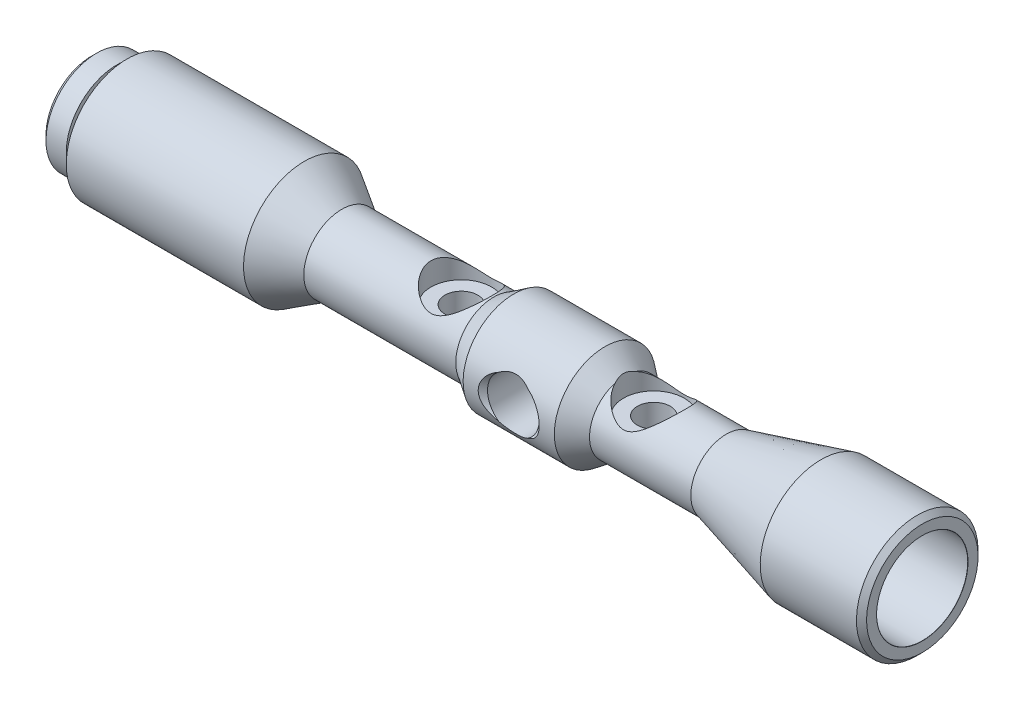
ISO-10303-21;
HEADER;
FILE_DESCRIPTION(('STEP AP214'),'2;1');
FILE_NAME('part.step','',(''),(''),'','','');
FILE_SCHEMA(('AUTOMOTIVE_DESIGN { 1 0 10303 214 1 1 1 1 }'));
ENDSEC;
DATA;
#1=APPLICATION_CONTEXT('core data for automotive mechanical design processes');
#2=APPLICATION_PROTOCOL_DEFINITION('international standard','automotive_design',2000,#1);
#3=PRODUCT_CONTEXT('',#1,'mechanical');
#4=PRODUCT('Part','Part','',(#3));
#5=PRODUCT_RELATED_PRODUCT_CATEGORY('part','',(#4));
#6=PRODUCT_DEFINITION_FORMATION('','',#4);
#7=PRODUCT_DEFINITION_CONTEXT('part definition',#1,'design');
#8=PRODUCT_DEFINITION('design','',#6,#7);
#9=PRODUCT_DEFINITION_SHAPE('','',#8);
#10=(LENGTH_UNIT() NAMED_UNIT(*) SI_UNIT(.MILLI.,.METRE.));
#11=(NAMED_UNIT(*) PLANE_ANGLE_UNIT() SI_UNIT($,.RADIAN.));
#12=(NAMED_UNIT(*) SI_UNIT($,.STERADIAN.) SOLID_ANGLE_UNIT());
#13=UNCERTAINTY_MEASURE_WITH_UNIT(LENGTH_MEASURE(1.E-05),#10,'distance_accuracy_value','');
#14=(GEOMETRIC_REPRESENTATION_CONTEXT(3) GLOBAL_UNCERTAINTY_ASSIGNED_CONTEXT((#13)) GLOBAL_UNIT_ASSIGNED_CONTEXT((#10,
#11,#12)) REPRESENTATION_CONTEXT('',''));
#15=CARTESIAN_POINT('',(0.,0.,0.));
#16=DIRECTION('',(0.,0.,1.));
#17=DIRECTION('',(1.,0.,0.));
#18=AXIS2_PLACEMENT_3D('',#15,#16,#17);
#19=CARTESIAN_POINT('',(-164.,0.,0.));
#20=DIRECTION('',(-1.,0.,0.));
#21=DIRECTION('',(0.,-1.,0.));
#22=AXIS2_PLACEMENT_3D('',#19,#20,#21);
#23=CYLINDRICAL_SURFACE('',#22,12.);
#24=CARTESIAN_POINT('',(-0.999999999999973,0.,0.));
#25=DIRECTION('',(-1.,0.,0.));
#26=DIRECTION('',(0.,-1.,0.));
#27=AXIS2_PLACEMENT_3D('',#24,#25,#26);
#28=CIRCLE('',#27,12.);
#29=CARTESIAN_POINT('',(-0.999999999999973,-12.,0.));
#30=VERTEX_POINT('',#29);
#31=EDGE_CURVE('E255',#30,#30,#28,.T.);
#32=ORIENTED_EDGE('',*,*,#31,.T.);
#33=EDGE_LOOP('',(#32));
#34=FACE_BOUND('',#33,.T.);
#35=CARTESIAN_POINT('',(-20.,0.,0.));
#36=DIRECTION('',(-1.,0.,0.));
#37=DIRECTION('',(0.,-1.,0.));
#38=AXIS2_PLACEMENT_3D('',#35,#36,#37);
#39=CIRCLE('',#38,12.);
#40=CARTESIAN_POINT('',(-20.,-12.,0.));
#41=VERTEX_POINT('',#40);
#42=EDGE_CURVE('E256',#41,#41,#39,.T.);
#43=ORIENTED_EDGE('',*,*,#42,.F.);
#44=EDGE_LOOP('',(#43));
#45=FACE_BOUND('',#44,.T.);
#46=ADVANCED_FACE('F53',(#34,#45),#23,.T.);
#47=CARTESIAN_POINT('',(-20.,0.,0.));
#48=DIRECTION('',(1.,0.,0.));
#49=DIRECTION('',(0.,1.,0.));
#50=AXIS2_PLACEMENT_3D('',#47,#48,#49);
#51=CONICAL_SURFACE('',#50,12.,0.261267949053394);
#52=CARTESIAN_POINT('',(-38.7,0.,0.));
#53=DIRECTION('',(-1.,0.,0.));
#54=DIRECTION('',(0.,-1.,0.));
#55=AXIS2_PLACEMENT_3D('',#52,#53,#54);
#56=CIRCLE('',#55,7.);
#57=CARTESIAN_POINT('',(-38.7,-7.,0.));
#58=VERTEX_POINT('',#57);
#59=EDGE_CURVE('E261',#58,#58,#56,.T.);
#60=ORIENTED_EDGE('',*,*,#59,.F.);
#61=EDGE_LOOP('',(#60));
#62=FACE_BOUND('',#61,.T.);
#63=ORIENTED_EDGE('',*,*,#42,.T.);
#64=EDGE_LOOP('',(#63));
#65=FACE_BOUND('',#64,.T.);
#66=ADVANCED_FACE('F223',(#62,#65),#51,.T.);
#67=CARTESIAN_POINT('',(-164.,0.,0.));
#68=DIRECTION('',(-1.,0.,0.));
#69=DIRECTION('',(0.,-1.,0.));
#70=AXIS2_PLACEMENT_3D('',#67,#68,#69);
#71=CYLINDRICAL_SURFACE('',#70,7.);
#72=CARTESIAN_POINT('',(-58.7,6.7446274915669,1.87349939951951));
#73=CARTESIAN_POINT('',(-58.6469038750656,6.69976646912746,2.03509626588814));
#74=CARTESIAN_POINT('',(-58.5873806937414,6.64963057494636,2.19297963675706));
#75=CARTESIAN_POINT('',(-58.4567659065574,6.54025851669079,2.50029492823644));
#76=CARTESIAN_POINT('',(-58.3856927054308,6.48103683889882,2.64973979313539));
#77=CARTESIAN_POINT('',(-58.233932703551,6.35549086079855,2.9380646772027));
#78=CARTESIAN_POINT('',(-58.1533609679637,6.28925239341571,3.07704329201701));
#79=CARTESIAN_POINT('',(-57.9829826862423,6.15042053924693,3.3459262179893));
#80=CARTESIAN_POINT('',(-57.8931724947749,6.0778246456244,3.47582691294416));
#81=CARTESIAN_POINT('',(-57.7058435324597,5.92805343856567,3.72548493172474));
#82=CARTESIAN_POINT('',(-57.6083791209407,5.85091124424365,3.8453031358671));
#83=CARTESIAN_POINT('',(-57.4059408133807,5.69283008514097,4.07568393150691));
#84=CARTESIAN_POINT('',(-57.3009676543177,5.61189149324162,4.18624742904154));
#85=CARTESIAN_POINT('',(-57.0833991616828,5.44693333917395,4.39876240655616));
#86=CARTESIAN_POINT('',(-56.9707638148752,5.36289885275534,4.50066124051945));
#87=CARTESIAN_POINT('',(-56.7387307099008,5.1934407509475,4.69519076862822));
#88=CARTESIAN_POINT('',(-56.6193322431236,5.10801699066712,4.78782048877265));
#89=CARTESIAN_POINT('',(-56.3480070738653,4.91911910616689,4.98239975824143));
#90=CARTESIAN_POINT('',(-56.1945314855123,4.81563832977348,5.08219377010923));
#91=CARTESIAN_POINT('',(-55.87756648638,4.6114701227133,5.26815048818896));
#92=CARTESIAN_POINT('',(-55.7140701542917,4.51078469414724,5.35430362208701));
#93=CARTESIAN_POINT('',(-55.3772655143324,4.31654211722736,5.51208040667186));
#94=CARTESIAN_POINT('',(-55.2040058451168,4.22295428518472,5.58376912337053));
#95=CARTESIAN_POINT('',(-54.8463820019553,4.04781604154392,5.71199815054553));
#96=CARTESIAN_POINT('',(-54.6620363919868,3.96624625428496,5.76856296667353));
#97=CARTESIAN_POINT('',(-54.2949409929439,3.82756725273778,5.86141985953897));
#98=CARTESIAN_POINT('',(-54.1130157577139,3.76912806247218,5.89887040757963));
#99=CARTESIAN_POINT('',(-53.8339037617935,3.69963193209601,5.94251370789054));
#100=CARTESIAN_POINT('',(-53.7399179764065,3.67950381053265,5.9549670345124));
#101=CARTESIAN_POINT('',(-53.5502797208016,3.64610948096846,5.97547260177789));
#102=CARTESIAN_POINT('',(-53.454628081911,3.632839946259,5.98352697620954));
#103=CARTESIAN_POINT('',(-53.2613967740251,3.61372412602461,5.99509185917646));
#104=CARTESIAN_POINT('',(-53.1638074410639,3.60794835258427,5.99855921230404));
#105=CARTESIAN_POINT('',(-52.9684314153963,3.60436661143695,6.00071213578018));
#106=CARTESIAN_POINT('',(-52.8706447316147,3.60656029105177,5.9993979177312));
#107=CARTESIAN_POINT('',(-52.6756513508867,3.61880109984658,5.99202204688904));
#108=CARTESIAN_POINT('',(-52.5784453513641,3.6288562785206,5.98595552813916));
#109=CARTESIAN_POINT('',(-52.385440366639,3.65630211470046,5.96923025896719));
#110=CARTESIAN_POINT('',(-52.2896422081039,3.6736969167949,5.95856891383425));
#111=CARTESIAN_POINT('',(-52.0779792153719,3.71982698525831,5.92990600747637));
#112=CARTESIAN_POINT('',(-51.962638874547,3.75026013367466,5.91077304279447));
#113=CARTESIAN_POINT('',(-51.7355852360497,3.81929548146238,5.8664009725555));
#114=CARTESIAN_POINT('',(-51.6238751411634,3.85790467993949,5.84115663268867));
#115=CARTESIAN_POINT('',(-51.4040648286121,3.94165560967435,5.78497166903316));
#116=CARTESIAN_POINT('',(-51.2959754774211,3.98681515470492,5.75401544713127));
#117=CARTESIAN_POINT('',(-51.083733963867,4.08204497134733,5.68685411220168));
#118=CARTESIAN_POINT('',(-50.9795808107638,4.13211399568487,5.65065033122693));
#119=CARTESIAN_POINT('',(-50.7064401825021,4.27067520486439,5.5473397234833));
#120=CARTESIAN_POINT('',(-50.540780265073,4.36243024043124,5.47578260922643));
#121=CARTESIAN_POINT('',(-50.2190635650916,4.551560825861,5.31962212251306));
#122=CARTESIAN_POINT('',(-50.063012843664,4.64893984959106,5.23501063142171));
#123=CARTESIAN_POINT('',(-49.7598454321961,4.84616835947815,5.05298820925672));
#124=CARTESIAN_POINT('',(-49.6127412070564,4.94602103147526,4.95555999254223));
#125=CARTESIAN_POINT('',(-49.3276030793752,5.14549712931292,4.74811257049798));
#126=CARTESIAN_POINT('',(-49.1895671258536,5.24512060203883,4.6380962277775));
#127=CARTESIAN_POINT('',(-48.9170069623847,5.44628520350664,4.40037076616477));
#128=CARTESIAN_POINT('',(-48.7828926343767,5.54772300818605,4.27210233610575));
#129=CARTESIAN_POINT('',(-48.525468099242,5.7458412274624,4.00167593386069));
#130=CARTESIAN_POINT('',(-48.4021600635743,5.84252068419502,3.85951518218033));
#131=CARTESIAN_POINT('',(-48.1678448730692,6.02865477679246,3.56175110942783));
#132=CARTESIAN_POINT('',(-48.05680548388,6.11812816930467,3.40618502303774));
#133=CARTESIAN_POINT('',(-47.8482125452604,6.2878647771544,3.08159880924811));
#134=CARTESIAN_POINT('',(-47.7506515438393,6.36813307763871,2.91258619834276));
#135=CARTESIAN_POINT('',(-47.5999444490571,6.49303073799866,2.61862087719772));
#136=CARTESIAN_POINT('',(-47.5426416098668,6.54078773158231,2.49710756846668));
#137=CARTESIAN_POINT('',(-47.4356627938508,6.63030841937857,2.24865118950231));
#138=CARTESIAN_POINT('',(-47.3859847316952,6.67207375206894,2.12170961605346));
#139=CARTESIAN_POINT('',(-47.29489326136,6.74889949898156,1.86294557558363));
#140=CARTESIAN_POINT('',(-47.2534780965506,6.78396133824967,1.73112415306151));
#141=CARTESIAN_POINT('',(-47.1795302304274,6.84671349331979,1.46335603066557));
#142=CARTESIAN_POINT('',(-47.14699333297,6.87440729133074,1.32741131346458));
#143=CARTESIAN_POINT('',(-47.0911371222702,6.92202613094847,1.051333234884));
#144=CARTESIAN_POINT('',(-47.0678798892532,6.94189883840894,0.911178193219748));
#145=CARTESIAN_POINT('',(-47.0313224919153,6.97316436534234,0.628632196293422));
#146=CARTESIAN_POINT('',(-47.0180223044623,6.98455720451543,0.486241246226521));
#147=CARTESIAN_POINT('',(-47.0016430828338,6.99859041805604,0.200477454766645));
#148=CARTESIAN_POINT('',(-46.9985614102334,7.00123305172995,0.0571048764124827));
#149=CARTESIAN_POINT('',(-47.0026752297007,6.99770698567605,-0.229377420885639));
#150=CARTESIAN_POINT('',(-47.009870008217,6.99153889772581,-0.372487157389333));
#151=CARTESIAN_POINT('',(-47.0332120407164,6.97155124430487,-0.643534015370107));
#152=CARTESIAN_POINT('',(-47.0484354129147,6.95852147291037,-0.771611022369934));
#153=CARTESIAN_POINT('',(-47.0869251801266,6.92563022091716,-1.02570134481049));
#154=CARTESIAN_POINT('',(-47.1101942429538,6.90576647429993,-1.15171396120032));
#155=CARTESIAN_POINT('',(-47.1644259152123,6.85957160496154,-1.40082743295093));
#156=CARTESIAN_POINT('',(-47.1953866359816,6.83324206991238,-1.52392899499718));
#157=CARTESIAN_POINT('',(-47.264583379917,6.77456054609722,-1.76661928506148));
#158=CARTESIAN_POINT('',(-47.3028221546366,6.74220627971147,-1.88620666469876));
#159=CARTESIAN_POINT('',(-47.4314676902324,6.63372757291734,-2.24925896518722));
#160=CARTESIAN_POINT('',(-47.5333805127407,6.54826987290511,-2.48599546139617));
#161=CARTESIAN_POINT('',(-47.762554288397,6.35820182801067,-2.93830065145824));
#162=CARTESIAN_POINT('',(-47.8898220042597,6.25358637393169,-3.15386367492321));
#163=CARTESIAN_POINT('',(-48.1305072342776,6.05874045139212,-3.5102299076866));
#164=CARTESIAN_POINT('',(-48.2391493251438,5.97166858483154,-3.65605803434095));
#165=CARTESIAN_POINT('',(-48.4671096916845,5.79156317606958,-3.93514598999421));
#166=CARTESIAN_POINT('',(-48.5864286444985,5.69852925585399,-4.06840502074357));
#167=CARTESIAN_POINT('',(-48.8352852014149,5.50803101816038,-4.32284084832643));
#168=CARTESIAN_POINT('',(-48.9648618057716,5.41055045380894,-4.44396713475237));
#169=CARTESIAN_POINT('',(-49.2332025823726,5.21348829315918,-4.67358740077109));
#170=CARTESIAN_POINT('',(-49.3719650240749,5.11390709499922,-4.78208374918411));
#171=CARTESIAN_POINT('',(-49.6614191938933,4.91274390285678,-4.98860086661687));
#172=CARTESIAN_POINT('',(-49.8122969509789,4.81116267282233,-5.08636178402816));
#173=CARTESIAN_POINT('',(-50.1237035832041,4.61073148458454,-5.2687292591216));
#174=CARTESIAN_POINT('',(-50.2842380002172,4.51188314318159,-5.35332816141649));
#175=CARTESIAN_POINT('',(-50.6147661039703,4.32101892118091,-5.50852442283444));
#176=CARTESIAN_POINT('',(-50.7847142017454,4.22897442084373,-5.57918279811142));
#177=CARTESIAN_POINT('',(-51.1353079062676,4.05632700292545,-5.70593042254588));
#178=CARTESIAN_POINT('',(-51.3159371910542,3.97570723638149,-5.76204122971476));
#179=CARTESIAN_POINT('',(-51.6791371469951,3.83642951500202,-5.85564072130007));
#180=CARTESIAN_POINT('',(-51.8611251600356,3.7768519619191,-5.89394187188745));
#181=CARTESIAN_POINT('',(-52.1404716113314,3.70549422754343,-5.93886367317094));
#182=CARTESIAN_POINT('',(-52.234562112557,3.68472014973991,-5.9517434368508));
#183=CARTESIAN_POINT('',(-52.4244699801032,3.65000512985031,-5.97309639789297));
#184=CARTESIAN_POINT('',(-52.5202864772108,3.63606084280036,-5.98157175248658));
#185=CARTESIAN_POINT('',(-52.7139596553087,3.61558574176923,-5.99397090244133));
#186=CARTESIAN_POINT('',(-52.8118271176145,3.60912844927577,-5.99784956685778));
#187=CARTESIAN_POINT('',(-53.0078337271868,3.6042287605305,-6.00079526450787));
#188=CARTESIAN_POINT('',(-53.1059728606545,3.60578596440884,-5.9998625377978));
#189=CARTESIAN_POINT('',(-53.3017238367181,3.61683243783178,-5.99320977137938));
#190=CARTESIAN_POINT('',(-53.3993351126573,3.62632898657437,-5.98748533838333));
#191=CARTESIAN_POINT('',(-53.5931933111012,3.65275836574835,-5.97139785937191));
#192=CARTESIAN_POINT('',(-53.6894394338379,3.66969538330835,-5.96103220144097));
#193=CARTESIAN_POINT('',(-53.9007824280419,3.71463877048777,-5.93315275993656));
#194=CARTESIAN_POINT('',(-54.015394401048,3.74425656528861,-5.91457100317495));
#195=CARTESIAN_POINT('',(-54.2410766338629,3.81164586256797,-5.87136716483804));
#196=CARTESIAN_POINT('',(-54.3521438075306,3.849424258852,-5.84673997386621));
#197=CARTESIAN_POINT('',(-54.5707291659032,3.9315259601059,-5.79185159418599));
#198=CARTESIAN_POINT('',(-54.6782368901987,3.9758667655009,-5.76157528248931));
#199=CARTESIAN_POINT('',(-54.8893714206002,4.06949395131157,-5.69583153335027));
#200=CARTESIAN_POINT('',(-54.992999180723,4.11877910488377,-5.66036538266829));
#201=CARTESIAN_POINT('',(-55.2649705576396,4.25539261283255,-5.55903939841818));
#202=CARTESIAN_POINT('',(-55.4300172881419,4.34603365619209,-5.48876847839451));
#203=CARTESIAN_POINT('',(-55.7506036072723,4.53308977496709,-5.33533273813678));
#204=CARTESIAN_POINT('',(-55.9061370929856,4.62950847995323,-5.25215975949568));
#205=CARTESIAN_POINT('',(-56.2084489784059,4.82502285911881,-5.07314107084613));
#206=CARTESIAN_POINT('',(-56.3552107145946,4.924123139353,-4.97727228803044));
#207=CARTESIAN_POINT('',(-56.6397853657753,5.12226776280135,-4.77311385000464));
#208=CARTESIAN_POINT('',(-56.7776004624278,5.22131211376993,-4.66482724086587));
#209=CARTESIAN_POINT('',(-57.050339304,5.42183703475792,-4.43041470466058));
#210=CARTESIAN_POINT('',(-57.1848268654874,5.52321511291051,-4.30369154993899));
#211=CARTESIAN_POINT('',(-57.4431554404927,5.72143155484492,-4.03644761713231));
#212=CARTESIAN_POINT('',(-57.566993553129,5.81826867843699,-3.89592310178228));
#213=CARTESIAN_POINT('',(-57.8023187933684,6.00476027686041,-3.6018090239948));
#214=CARTESIAN_POINT('',(-57.9138618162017,6.09444669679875,-3.44828471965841));
#215=CARTESIAN_POINT('',(-58.1237216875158,6.26488510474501,-3.12795413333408));
#216=CARTESIAN_POINT('',(-58.2220494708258,6.34564446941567,-2.96115901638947));
#217=CARTESIAN_POINT('',(-58.3884421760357,6.48332513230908,-2.64406748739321));
#218=CARTESIAN_POINT('',(-58.4588141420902,6.54196961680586,-2.49573361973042));
#219=CARTESIAN_POINT('',(-58.5882502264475,6.65036267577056,-2.19066897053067));
#220=CARTESIAN_POINT('',(-58.647287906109,6.70009043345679,-2.03391962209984));
#221=CARTESIAN_POINT('',(-58.7,6.7446274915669,-1.87349939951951));
#222=B_SPLINE_CURVE_WITH_KNOTS('',3,(#72,#73,#74,#75,#76,#77,#78,#79,#80,#81,#82,#83,#84,#85,
#86,#87,#88,#89,#90,#91,#92,#93,#94,#95,#96,#97,#98,#99,#100,#101,#102,#103,#104,#105,#106,#107,
#108,#109,#110,#111,#112,#113,#114,#115,#116,#117,#118,#119,#120,#121,#122,#123,#124,#125,#126,
#127,#128,#129,#130,#131,#132,#133,#134,#135,#136,#137,#138,#139,#140,#141,#142,#143,#144,#145,
#146,#147,#148,#149,#150,#151,#152,#153,#154,#155,#156,#157,#158,#159,#160,#161,#162,#163,#164,
#165,#166,#167,#168,#169,#170,#171,#172,#173,#174,#175,#176,#177,#178,#179,#180,#181,#182,#183,
#184,#185,#186,#187,#188,#189,#190,#191,#192,#193,#194,#195,#196,#197,#198,#199,#200,#201,#202,
#203,#204,#205,#206,#207,#208,#209,#210,#211,#212,#213,#214,#215,#216,#217,#218,#219,#220,#221),
.UNSPECIFIED.,.F.,.F.,(4,2,2,2,2,2,2,2,2,2,2,2,2,2,2,2,2,2,2,2,2,2,2,2,2,2,2,2,2,2,2,2,2,2,2,2,
2,2,2,2,2,2,2,2,2,2,2,2,2,2,2,2,2,2,2,2,2,2,2,2,2,2,2,2,2,2,2,2,2,2,2,2,2,2,4),(0.,
0.527321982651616,1.05381178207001,1.57447649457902,2.09534744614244,2.61280581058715,
3.13021345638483,3.65056850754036,4.17097818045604,4.80116026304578,5.43178262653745,
6.05950167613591,6.68619736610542,7.26817971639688,7.55863941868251,7.8489581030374,
8.14198917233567,8.43500727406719,8.72832579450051,9.0218101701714,9.38366735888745,
9.74583557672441,10.1090078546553,10.4720881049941,11.0784913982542,11.6852733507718,
12.2928822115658,12.9003531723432,13.5340891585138,14.1679521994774,14.8001081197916,
15.4319131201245,15.8592786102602,16.2865270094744,16.7136844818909,17.1406397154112,
17.5704051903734,18.0001696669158,18.42982316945,18.8594468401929,19.2479040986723,
19.6364902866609,20.0249811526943,20.413619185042,21.2249424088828,22.0364823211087,
22.6405773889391,23.2447107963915,23.8512630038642,24.4577012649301,25.0765514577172,
25.6957602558,26.3121955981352,26.9277121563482,27.5114218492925,27.8027636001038,
28.0939625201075,28.3879973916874,28.6820175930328,28.9763076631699,29.2707635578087,
29.6296692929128,29.9888794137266,30.3490653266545,30.7091620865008,31.3111921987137,
31.9136045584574,32.5171271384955,33.1205019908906,33.752077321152,34.3838241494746,
35.0125689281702,35.6407902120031,36.1630473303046,36.6865082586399),.UNSPECIFIED.);
#223=CARTESIAN_POINT('',(-58.7,6.74462749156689,1.87349939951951));
#224=VERTEX_POINT('',#223);
#225=CARTESIAN_POINT('',(-58.7,6.7446274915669,-1.87349939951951));
#226=VERTEX_POINT('',#225);
#227=EDGE_CURVE('E83',#224,#226,#222,.T.);
#228=ORIENTED_EDGE('',*,*,#227,.F.);
#229=CARTESIAN_POINT('',(-58.7,0.,0.));
#230=DIRECTION('',(-1.,0.,0.));
#231=DIRECTION('',(0.,-1.,0.));
#232=AXIS2_PLACEMENT_3D('',#229,#230,#231);
#233=CIRCLE('',#232,7.);
#234=EDGE_CURVE('E382',#226,#224,#233,.T.);
#235=ORIENTED_EDGE('',*,*,#234,.F.);
#236=EDGE_LOOP('',(#228,#235));
#237=FACE_BOUND('',#236,.T.);
#238=CARTESIAN_POINT('',(-49.75,-7.,0.));
#239=CARTESIAN_POINT('',(-49.7500011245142,-6.99999913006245,0.0861856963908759));
#240=CARTESIAN_POINT('',(-49.7534350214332,-6.99840259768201,0.172391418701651));
#241=CARTESIAN_POINT('',(-49.7671221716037,-6.99206483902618,0.344155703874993));
#242=CARTESIAN_POINT('',(-49.7773790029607,-6.98732196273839,0.429713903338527));
#243=CARTESIAN_POINT('',(-49.8182968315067,-6.96850705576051,0.684731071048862));
#244=CARTESIAN_POINT('',(-49.8591048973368,-6.949849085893,0.852354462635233));
#245=CARTESIAN_POINT('',(-49.9658058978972,-6.9022888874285,1.17699843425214));
#246=CARTESIAN_POINT('',(-50.031606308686,-6.87342447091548,1.33405563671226));
#247=CARTESIAN_POINT('',(-50.1859881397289,-6.80817682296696,1.63474648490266));
#248=CARTESIAN_POINT('',(-50.2745655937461,-6.77179490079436,1.7783824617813));
#249=CARTESIAN_POINT('',(-50.4775065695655,-6.69262946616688,2.05689284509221));
#250=CARTESIAN_POINT('',(-50.5930090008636,-6.64960563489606,2.1908681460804));
#251=CARTESIAN_POINT('',(-50.844054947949,-6.56290303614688,2.43834503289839));
#252=CARTESIAN_POINT('',(-50.9796114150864,-6.51922386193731,2.55183328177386));
#253=CARTESIAN_POINT('',(-51.2775904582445,-6.43293703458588,2.76244761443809));
#254=CARTESIAN_POINT('',(-51.4411809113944,-6.390579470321,2.85804962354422));
#255=CARTESIAN_POINT('',(-51.6983238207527,-6.33441607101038,2.97945647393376));
#256=CARTESIAN_POINT('',(-51.7860311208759,-6.31691882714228,3.01626861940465));
#257=CARTESIAN_POINT('',(-51.9648168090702,-6.28501296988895,3.08219962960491));
#258=CARTESIAN_POINT('',(-52.0558932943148,-6.2706026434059,3.11132276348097));
#259=CARTESIAN_POINT('',(-52.2356429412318,-6.24613907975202,3.16013471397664));
#260=CARTESIAN_POINT('',(-52.3241726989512,-6.23588976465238,3.18025438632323));
#261=CARTESIAN_POINT('',(-52.5029057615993,-6.21905884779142,3.21304328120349));
#262=CARTESIAN_POINT('',(-52.5931082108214,-6.21247542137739,3.22571621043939));
#263=CARTESIAN_POINT('',(-52.7744278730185,-6.20324085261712,3.24344056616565));
#264=CARTESIAN_POINT('',(-52.8655446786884,-6.2005880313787,3.24849524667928));
#265=CARTESIAN_POINT('',(-53.0478799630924,-6.19931097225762,3.2509281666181));
#266=CARTESIAN_POINT('',(-53.1390984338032,-6.20068643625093,3.24830697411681));
#267=CARTESIAN_POINT('',(-53.3935633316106,-6.21013911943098,3.23023537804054));
#268=CARTESIAN_POINT('',(-53.5561306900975,-6.22269266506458,3.20620834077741));
#269=CARTESIAN_POINT('',(-53.8744887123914,-6.25916103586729,3.13440110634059));
#270=CARTESIAN_POINT('',(-54.0302776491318,-6.28307873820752,3.08661489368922));
#271=CARTESIAN_POINT('',(-54.3351059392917,-6.34011527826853,2.96772025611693));
#272=CARTESIAN_POINT('',(-54.4839074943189,-6.37343317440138,2.89610047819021));
#273=CARTESIAN_POINT('',(-54.7680348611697,-6.44550317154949,2.73194278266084));
#274=CARTESIAN_POINT('',(-54.90335476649,-6.48425763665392,2.63939575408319));
#275=CARTESIAN_POINT('',(-55.1719796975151,-6.5678754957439,2.42439272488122));
#276=CARTESIAN_POINT('',(-55.3035092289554,-6.61294809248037,2.29979258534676));
#277=CARTESIAN_POINT('',(-55.5444820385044,-6.70069225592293,2.02998577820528));
#278=CARTESIAN_POINT('',(-55.6539173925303,-6.74336295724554,1.88477174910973));
#279=CARTESIAN_POINT('',(-55.8511090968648,-6.8233354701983,1.57134193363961));
#280=CARTESIAN_POINT('',(-55.937974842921,-6.86039773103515,1.40249994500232));
#281=CARTESIAN_POINT('',(-56.081418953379,-6.92303804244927,1.05043674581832));
#282=CARTESIAN_POINT('',(-56.1380181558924,-6.94862399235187,0.867225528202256));
#283=CARTESIAN_POINT('',(-56.215218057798,-6.9838417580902,0.506307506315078));
#284=CARTESIAN_POINT('',(-56.2381908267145,-6.99452205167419,0.329210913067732));
#285=CARTESIAN_POINT('',(-56.2547621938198,-7.00220752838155,-0.0266202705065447));
#286=CARTESIAN_POINT('',(-56.2483720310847,-6.99921794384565,-0.20535420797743));
#287=CARTESIAN_POINT('',(-56.2079322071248,-6.98054813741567,-0.547150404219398));
#288=CARTESIAN_POINT('',(-56.1756975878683,-6.96570092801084,-0.710478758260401));
#289=CARTESIAN_POINT('',(-56.0871852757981,-6.92579653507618,-1.02914713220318));
#290=CARTESIAN_POINT('',(-56.0309047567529,-6.90073815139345,-1.18448621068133));
#291=CARTESIAN_POINT('',(-55.8941831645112,-6.84177485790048,-1.48822015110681));
#292=CARTESIAN_POINT('',(-55.8130526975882,-6.80762172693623,-1.63625485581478));
#293=CARTESIAN_POINT('',(-55.6296872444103,-6.73392242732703,-1.91713534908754));
#294=CARTESIAN_POINT('',(-55.5274429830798,-6.69437389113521,-2.04997442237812));
#295=CARTESIAN_POINT('',(-55.2944172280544,-6.60977036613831,-2.30891012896));
#296=CARTESIAN_POINT('',(-55.1619263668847,-6.56453572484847,-2.43341327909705));
#297=CARTESIAN_POINT('',(-54.8775193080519,-6.4764428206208,-2.65902019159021));
#298=CARTESIAN_POINT('',(-54.7255941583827,-6.43358566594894,-2.76011310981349));
#299=CARTESIAN_POINT('',(-54.4003751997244,-6.35397329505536,-2.93886459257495));
#300=CARTESIAN_POINT('',(-54.2265601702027,-6.31745196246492,-3.01568755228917));
#301=CARTESIAN_POINT('',(-53.8662065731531,-6.25751015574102,-3.13819963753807));
#302=CARTESIAN_POINT('',(-53.6796821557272,-6.23407537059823,-3.18392278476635));
#303=CARTESIAN_POINT('',(-53.317176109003,-6.20551630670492,-3.23920474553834));
#304=CARTESIAN_POINT('',(-53.141747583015,-6.19893936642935,-3.25163716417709));
#305=CARTESIAN_POINT('',(-52.7912908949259,-6.20083820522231,-3.24801791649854));
#306=CARTESIAN_POINT('',(-52.6162626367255,-6.20930988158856,-3.23197401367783));
#307=CARTESIAN_POINT('',(-52.2846401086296,-6.23889803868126,-3.17443948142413));
#308=CARTESIAN_POINT('',(-52.1276222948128,-6.2590677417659,-3.13484904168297));
#309=CARTESIAN_POINT('',(-51.8225253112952,-6.30882368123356,-3.03346557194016));
#310=CARTESIAN_POINT('',(-51.6744488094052,-6.33841271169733,-2.97166595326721));
#311=CARTESIAN_POINT('',(-51.3806907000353,-6.40608082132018,-2.82297889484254));
#312=CARTESIAN_POINT('',(-51.2358134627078,-6.44459162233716,-2.7347038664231));
#313=CARTESIAN_POINT('',(-50.9620405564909,-6.52484606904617,-2.53726786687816));
#314=CARTESIAN_POINT('',(-50.833152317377,-6.56659120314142,-2.42809724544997));
#315=CARTESIAN_POINT('',(-50.5818240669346,-6.65355688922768,-2.17927051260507));
#316=CARTESIAN_POINT('',(-50.4612832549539,-6.69871272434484,-2.03766698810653));
#317=CARTESIAN_POINT('',(-50.2453585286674,-6.78348447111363,-1.73464778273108));
#318=CARTESIAN_POINT('',(-50.1499865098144,-6.82309775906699,-1.57322278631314));
#319=CARTESIAN_POINT('',(-50.0286425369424,-6.87496622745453,-1.3199513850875));
#320=CARTESIAN_POINT('',(-49.991876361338,-6.89096753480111,-1.23389302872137));
#321=CARTESIAN_POINT('',(-49.9257806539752,-6.92007501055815,-1.05850829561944));
#322=CARTESIAN_POINT('',(-49.8964475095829,-6.93318258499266,-0.96918353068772));
#323=CARTESIAN_POINT('',(-49.8456158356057,-6.95608561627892,-0.78815219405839));
#324=CARTESIAN_POINT('',(-49.8240991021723,-6.965888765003,-0.696451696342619));
#325=CARTESIAN_POINT('',(-49.7890855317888,-6.98192147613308,-0.511269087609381));
#326=CARTESIAN_POINT('',(-49.7755833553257,-6.98815341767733,-0.417788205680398));
#327=CARTESIAN_POINT('',(-49.7607899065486,-6.99499550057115,-0.270075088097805));
#328=CARTESIAN_POINT('',(-49.7567458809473,-6.99687012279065,-0.216160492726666));
#329=CARTESIAN_POINT('',(-49.7513505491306,-6.99937265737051,-0.108166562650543));
#330=CARTESIAN_POINT('',(-49.7499992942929,-7.00000054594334,-0.0540872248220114));
#331=CARTESIAN_POINT('',(-49.75,-7.,0.));
#332=B_SPLINE_CURVE_WITH_KNOTS('',3,(#238,#239,#240,#241,#242,#243,#244,#245,#246,#247,#248,
#249,#250,#251,#252,#253,#254,#255,#256,#257,#258,#259,#260,#261,#262,#263,#264,#265,#266,#267,
#268,#269,#270,#271,#272,#273,#274,#275,#276,#277,#278,#279,#280,#281,#282,#283,#284,#285,#286,
#287,#288,#289,#290,#291,#292,#293,#294,#295,#296,#297,#298,#299,#300,#301,#302,#303,#304,#305,
#306,#307,#308,#309,#310,#311,#312,#313,#314,#315,#316,#317,#318,#319,#320,#321,#322,#323,#324,
#325,#326,#327,#328,#329,#330,#331),.UNSPECIFIED.,.T.,.F.,(4,2,2,2,2,2,2,2,2,2,2,2,2,2,2,2,2,2,
2,2,2,2,2,2,2,2,2,2,2,2,2,2,2,2,2,2,2,2,2,2,2,2,2,2,2,2,4),(0.,0.258499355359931,
0.517134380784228,1.03493166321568,1.55083040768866,2.06663937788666,2.61045344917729,
3.15462027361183,3.73382572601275,4.02363573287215,4.3132844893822,4.58699950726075,
4.86057816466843,5.13403993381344,5.40748146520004,5.89938587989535,6.39141490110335,
6.89476573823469,7.39833613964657,7.95596105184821,8.51378560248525,9.09109180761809,
9.66800003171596,10.2018381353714,10.7354719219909,11.2346035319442,11.7337938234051,
12.2483263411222,12.7630853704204,13.3226531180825,13.8824795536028,14.4598862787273,
15.0366603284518,15.5617481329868,16.0866928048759,16.5741279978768,17.0617079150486,
17.5814966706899,18.1015260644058,18.6729991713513,19.2447418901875,19.5292427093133,
19.8136049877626,20.0973006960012,20.380807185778,20.5430295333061,20.7052549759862),.UNSPECIFIED.);
#333=CARTESIAN_POINT('',(-49.75,-7.,0.));
#334=VERTEX_POINT('',#333);
#335=EDGE_CURVE('E140',#334,#334,#332,.T.);
#336=ORIENTED_EDGE('',*,*,#335,.F.);
#337=EDGE_LOOP('',(#336));
#338=FACE_BOUND('',#337,.T.);
#339=ORIENTED_EDGE('',*,*,#59,.T.);
#340=EDGE_LOOP('',(#339));
#341=FACE_BOUND('',#340,.T.);
#342=ADVANCED_FACE('F143',(#237,#338,#341),#71,.T.);
#343=CARTESIAN_POINT('',(-62.65,0.,0.));
#344=DIRECTION('',(-1.,0.,0.));
#345=DIRECTION('',(0.,-1.,0.));
#346=AXIS2_PLACEMENT_3D('',#343,#344,#345);
#347=CONICAL_SURFACE('',#346,9.99999999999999,0.649549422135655);
#348=CARTESIAN_POINT('',(-57.7156852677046,5.03293485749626,-3.70975908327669));
#349=CARTESIAN_POINT('',(-57.7894603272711,5.17164938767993,-3.61594494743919));
#350=CARTESIAN_POINT('',(-57.8630742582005,5.30691820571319,-3.51664149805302));
#351=CARTESIAN_POINT('',(-58.008695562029,5.56965977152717,-3.305979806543));
#352=CARTESIAN_POINT('',(-58.0806954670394,5.69709972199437,-3.19457563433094));
#353=CARTESIAN_POINT('',(-58.2207459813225,5.94137449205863,-2.96012216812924));
#354=CARTESIAN_POINT('',(-58.288819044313,6.05827234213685,-2.83715251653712));
#355=CARTESIAN_POINT('',(-58.4195643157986,6.28018764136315,-2.57861390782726));
#356=CARTESIAN_POINT('',(-58.4822470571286,6.38522839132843,-2.4430706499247));
#357=CARTESIAN_POINT('',(-58.5638026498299,6.52066164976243,-2.24668066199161));
#358=CARTESIAN_POINT('',(-58.585860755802,6.55715242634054,-2.19129857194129));
#359=CARTESIAN_POINT('',(-58.6287723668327,6.62790871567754,-2.07859650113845));
#360=CARTESIAN_POINT('',(-58.6496246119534,6.6621719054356,-2.02127458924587));
#361=CARTESIAN_POINT('',(-58.7269799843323,6.78890411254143,-1.79784032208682));
#362=CARTESIAN_POINT('',(-58.7787231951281,6.87286664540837,-1.62502651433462));
#363=CARTESIAN_POINT('',(-58.8678604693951,7.01676218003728,-1.26583647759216));
#364=CARTESIAN_POINT('',(-58.9052480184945,7.07668427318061,-1.07945413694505));
#365=CARTESIAN_POINT('',(-58.9482690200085,7.14545125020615,-0.792228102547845));
#366=CARTESIAN_POINT('',(-58.9604550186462,7.16488934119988,-0.694801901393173));
#367=CARTESIAN_POINT('',(-58.9800871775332,7.19617483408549,-0.498283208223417));
#368=CARTESIAN_POINT('',(-58.9875353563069,7.20802546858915,-0.399191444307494));
#369=CARTESIAN_POINT('',(-58.9974876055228,7.2238556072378,-0.200162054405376));
#370=CARTESIAN_POINT('',(-58.9999932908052,7.2278376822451,-0.100224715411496));
#371=CARTESIAN_POINT('',(-59.0000066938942,7.22785849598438,0.0996214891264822));
#372=CARTESIAN_POINT('',(-58.9975148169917,7.22389787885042,0.1995303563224));
#373=CARTESIAN_POINT('',(-58.9834546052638,7.2015364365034,0.480958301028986));
#374=CARTESIAN_POINT('',(-58.9660791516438,7.17389413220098,0.661551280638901));
#375=CARTESIAN_POINT('',(-58.9162338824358,7.09426385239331,1.01494416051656));
#376=CARTESIAN_POINT('',(-58.8837642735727,7.04227621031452,1.187744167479));
#377=CARTESIAN_POINT('',(-58.8204063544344,6.9401996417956,1.46108380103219));
#378=CARTESIAN_POINT('',(-58.7932845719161,6.89637297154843,1.5649334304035));
#379=CARTESIAN_POINT('',(-58.7346591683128,6.80120923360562,1.76771013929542));
#380=CARTESIAN_POINT('',(-58.7031604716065,6.74988060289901,1.86664258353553));
#381=CARTESIAN_POINT('',(-58.6507162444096,6.66396018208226,2.01812054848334));
#382=CARTESIAN_POINT('',(-58.6310232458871,6.63160633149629,2.07239862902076));
#383=CARTESIAN_POINT('',(-58.5189318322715,6.4468513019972,2.36825313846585));
#384=CARTESIAN_POINT('',(-58.4156939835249,6.27452445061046,2.59340395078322));
#385=CARTESIAN_POINT('',(-58.1954680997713,5.89841333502,3.01045536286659));
#386=CARTESIAN_POINT('',(-58.0784196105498,5.69448944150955,3.20219993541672));
#387=CARTESIAN_POINT('',(-57.9595190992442,5.48084345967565,3.37685805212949));
#388=B_SPLINE_CURVE_WITH_KNOTS('',3,(#348,#349,#350,#351,#352,#353,#354,#355,#356,#357,#358,
#359,#360,#361,#362,#363,#364,#365,#366,#367,#368,#369,#370,#371,#372,#373,#374,#375,#376,#377,
#378,#379,#380,#381,#382,#383,#384,#385,#386,#387),.UNSPECIFIED.,.F.,.F.,(4,2,2,2,2,2,2,2,2,2,2,
2,2,2,2,2,2,2,2,4),(0.,0.549067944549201,1.10029803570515,1.64797704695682,2.19456033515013,
2.40418201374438,2.61401889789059,3.2087271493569,3.80370495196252,4.1036239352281,
4.40341505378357,4.70310820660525,5.00277705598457,5.55058397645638,6.09838339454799,
6.4457923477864,6.7928135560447,6.99132597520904,7.89183654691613,8.79644642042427),.UNSPECIFIED.);
#389=EDGE_CURVE('E160',#226,#224,#388,.T.);
#390=ORIENTED_EDGE('',*,*,#389,.F.);
#391=ORIENTED_EDGE('',*,*,#234,.T.);
#392=EDGE_LOOP('',(#390,#391));
#393=FACE_BOUND('',#392,.T.);
#394=CARTESIAN_POINT('',(-62.65,0.,0.));
#395=DIRECTION('',(-1.,0.,0.));
#396=DIRECTION('',(0.,-1.,0.));
#397=AXIS2_PLACEMENT_3D('',#394,#395,#396);
#398=CIRCLE('',#397,9.99999999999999);
#399=CARTESIAN_POINT('',(-62.65,-9.99999999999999,0.));
#400=VERTEX_POINT('',#399);
#401=EDGE_CURVE('E379',#400,#400,#398,.T.);
#402=ORIENTED_EDGE('',*,*,#401,.F.);
#403=EDGE_LOOP('',(#402));
#404=FACE_BOUND('',#403,.T.);
#405=ADVANCED_FACE('F178',(#393,#404),#347,.T.);
#406=CARTESIAN_POINT('',(-164.,0.,0.));
#407=DIRECTION('',(-1.,0.,0.));
#408=DIRECTION('',(0.,-1.,0.));
#409=AXIS2_PLACEMENT_3D('',#406,#407,#408);
#410=CYLINDRICAL_SURFACE('',#409,9.99999999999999);
#411=CARTESIAN_POINT('',(-74.5423390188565,4.20052080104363,9.07499999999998));
#412=CARTESIAN_POINT('',(-74.4334689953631,4.27548821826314,9.04029959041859));
#413=CARTESIAN_POINT('',(-74.3214938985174,4.34634759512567,9.00637296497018));
#414=CARTESIAN_POINT('',(-74.0917679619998,4.47944149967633,8.94092340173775));
#415=CARTESIAN_POINT('',(-73.9740136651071,4.54167077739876,8.90940193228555));
#416=CARTESIAN_POINT('',(-73.7327044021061,4.65728765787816,8.84951593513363));
#417=CARTESIAN_POINT('',(-73.609123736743,4.71063023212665,8.82116771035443));
#418=CARTESIAN_POINT('',(-73.3573529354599,4.80761271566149,8.76868877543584));
#419=CARTESIAN_POINT('',(-73.2291633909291,4.85125386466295,8.74455752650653));
#420=CARTESIAN_POINT('',(-72.968314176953,4.92855309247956,8.70122637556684));
#421=CARTESIAN_POINT('',(-72.8356364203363,4.96216357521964,8.68205004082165));
#422=CARTESIAN_POINT('',(-72.5673845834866,5.01868321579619,8.64950203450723));
#423=CARTESIAN_POINT('',(-72.4318120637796,5.04159799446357,8.63612731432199));
#424=CARTESIAN_POINT('',(-72.1591889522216,5.07637198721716,8.61573297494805));
#425=CARTESIAN_POINT('',(-72.022143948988,5.08826384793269,8.60869459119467));
#426=CARTESIAN_POINT('',(-71.7473680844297,5.10092446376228,8.60119912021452));
#427=CARTESIAN_POINT('',(-71.6096372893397,5.10169427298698,8.60074140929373));
#428=CARTESIAN_POINT('',(-71.3460826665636,5.09250014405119,8.60618746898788));
#429=CARTESIAN_POINT('',(-71.2202159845,5.08341849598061,8.61156835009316));
#430=CARTESIAN_POINT('',(-70.9697995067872,5.05600626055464,8.62769107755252));
#431=CARTESIAN_POINT('',(-70.8452501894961,5.03767242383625,8.63843480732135));
#432=CARTESIAN_POINT('',(-70.5981006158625,4.99192646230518,8.66495058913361));
#433=CARTESIAN_POINT('',(-70.4755049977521,4.96449536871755,8.68073314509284));
#434=CARTESIAN_POINT('',(-70.2332720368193,4.9008765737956,8.71680795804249));
#435=CARTESIAN_POINT('',(-70.1136359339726,4.86468526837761,8.73710207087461));
#436=CARTESIAN_POINT('',(-69.7739242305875,4.74818359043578,8.80126828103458));
#437=CARTESIAN_POINT('',(-69.5583366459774,4.6571156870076,8.85014801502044));
#438=CARTESIAN_POINT('',(-69.2478982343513,4.50036995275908,8.93028990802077));
#439=CARTESIAN_POINT('',(-69.1467689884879,4.44489750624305,8.95807737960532));
#440=CARTESIAN_POINT('',(-68.9488901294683,4.32749304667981,9.01537982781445));
#441=CARTESIAN_POINT('',(-68.8521389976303,4.2655632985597,9.04489419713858));
#442=CARTESIAN_POINT('',(-68.7576609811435,4.20052080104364,9.07499999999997));
#443=B_SPLINE_CURVE_WITH_KNOTS('',3,(#411,#412,#413,#414,#415,#416,#417,#418,#419,#420,#421,
#422,#423,#424,#425,#426,#427,#428,#429,#430,#431,#432,#433,#434,#435,#436,#437,#438,#439,#440,
#441,#442),.UNSPECIFIED.,.F.,.F.,(4,2,2,2,2,2,2,2,2,2,2,2,2,2,2,4),(0.,0.409927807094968,
0.820103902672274,1.23229898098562,1.64444135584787,2.05850936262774,2.47235952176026,
2.88498002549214,3.29756142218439,3.6760272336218,4.05462605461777,4.4340193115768,
4.81356892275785,5.52790825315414,5.88363058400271,6.23922856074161),.UNSPECIFIED.);
#444=CARTESIAN_POINT('',(-74.5423390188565,4.20052080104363,9.07499999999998));
#445=VERTEX_POINT('',#444);
#446=CARTESIAN_POINT('',(-68.7576609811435,4.20052080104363,9.07499999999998));
#447=VERTEX_POINT('',#446);
#448=EDGE_CURVE('E58',#445,#447,#443,.T.);
#449=ORIENTED_EDGE('',*,*,#448,.T.);
#450=CARTESIAN_POINT('',(-71.205922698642,4.78520326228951,8.78076475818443));
#451=CARTESIAN_POINT('',(-71.0388708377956,4.77518961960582,8.78619377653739));
#452=CARTESIAN_POINT('',(-70.8722722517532,4.75950987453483,8.79474390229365));
#453=CARTESIAN_POINT('',(-70.5409595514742,4.71691009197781,8.81767968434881));
#454=CARTESIAN_POINT('',(-70.3762450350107,4.6899925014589,8.83206407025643));
#455=CARTESIAN_POINT('',(-70.0492262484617,4.62492917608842,8.86630404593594));
#456=CARTESIAN_POINT('',(-69.8869284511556,4.5867575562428,8.88617224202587));
#457=CARTESIAN_POINT('',(-69.566026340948,4.49931490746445,8.93076596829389));
#458=CARTESIAN_POINT('',(-69.4074223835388,4.45004281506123,8.95549196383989));
#459=CARTESIAN_POINT('',(-69.0784577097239,4.3347591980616,9.01190335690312));
#460=CARTESIAN_POINT('',(-68.9085955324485,4.26753793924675,9.04404558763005));
#461=CARTESIAN_POINT('',(-68.5756028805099,4.11973600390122,9.11232067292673));
#462=CARTESIAN_POINT('',(-68.4124757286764,4.03914882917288,9.14845546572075));
#463=CARTESIAN_POINT('',(-67.9353187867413,3.77745387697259,9.26104898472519));
#464=CARTESIAN_POINT('',(-67.632843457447,3.57618125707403,9.34181882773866));
#465=CARTESIAN_POINT('',(-67.139883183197,3.17526300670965,9.48426595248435));
#466=CARTESIAN_POINT('',(-66.9400114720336,2.98701303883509,9.54583299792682));
#467=CARTESIAN_POINT('',(-66.5726722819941,2.57972736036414,9.66383649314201));
#468=CARTESIAN_POINT('',(-66.4051509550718,2.36074387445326,9.72028138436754));
#469=CARTESIAN_POINT('',(-66.1415347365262,1.94143325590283,9.81157984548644));
#470=CARTESIAN_POINT('',(-66.0378439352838,1.74633743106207,9.8484905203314));
#471=CARTESIAN_POINT('',(-65.8623255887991,1.34046643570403,9.91186479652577));
#472=CARTESIAN_POINT('',(-65.7904759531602,1.12970225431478,9.93833563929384));
#473=CARTESIAN_POINT('',(-65.7101538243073,0.805214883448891,9.96813183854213));
#474=CARTESIAN_POINT('',(-65.6879220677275,0.695205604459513,9.97642524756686));
#475=CARTESIAN_POINT('',(-65.6532200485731,0.473465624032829,9.98940074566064));
#476=CARTESIAN_POINT('',(-65.6407452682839,0.361735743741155,9.99408450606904));
#477=CARTESIAN_POINT('',(-65.6258395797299,0.137521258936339,9.99968308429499));
#478=CARTESIAN_POINT('',(-65.6234077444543,0.0250367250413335,10.0005982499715));
#479=CARTESIAN_POINT('',(-65.6286193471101,-0.199630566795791,9.99863966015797));
#480=CARTESIAN_POINT('',(-65.6362619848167,-0.311813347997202,9.99576620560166));
#481=CARTESIAN_POINT('',(-65.6713687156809,-0.622153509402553,9.98260130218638));
#482=CARTESIAN_POINT('',(-65.709652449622,-0.819020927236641,9.96826879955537));
#483=CARTESIAN_POINT('',(-65.8153084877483,-1.2034940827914,9.92920423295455));
#484=CARTESIAN_POINT('',(-65.8826846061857,-1.39109860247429,9.90447080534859));
#485=CARTESIAN_POINT('',(-66.046958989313,-1.76303340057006,9.84525175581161));
#486=CARTESIAN_POINT('',(-66.1452006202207,-1.94669580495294,9.81032896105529));
#487=CARTESIAN_POINT('',(-66.3652547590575,-2.29783693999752,9.73408051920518));
#488=CARTESIAN_POINT('',(-66.4870886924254,-2.46530075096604,9.69274905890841));
#489=CARTESIAN_POINT('',(-66.8172544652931,-2.86391341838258,9.58434913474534));
#490=CARTESIAN_POINT('',(-67.0380573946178,-3.08411550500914,9.51488502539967));
#491=CARTESIAN_POINT('',(-67.5129469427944,-3.48470428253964,9.37560482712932));
#492=CARTESIAN_POINT('',(-67.7670652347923,-3.66505264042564,9.30578846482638));
#493=CARTESIAN_POINT('',(-68.2252031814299,-3.94092049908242,9.1915527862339));
#494=CARTESIAN_POINT('',(-68.4231577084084,-4.04602252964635,9.14552124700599));
#495=CARTESIAN_POINT('',(-68.8297075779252,-4.2359014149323,9.05914122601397));
#496=CARTESIAN_POINT('',(-69.0382985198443,-4.32068659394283,9.01879041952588));
#497=CARTESIAN_POINT('',(-69.4249831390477,-4.4561961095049,8.95248020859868));
#498=CARTESIAN_POINT('',(-69.6016812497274,-4.51031361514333,8.9252384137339));
#499=CARTESIAN_POINT('',(-69.9595964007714,-4.60481764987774,8.87685084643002));
#500=CARTESIAN_POINT('',(-70.1408146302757,-4.64520052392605,8.85570669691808));
#501=CARTESIAN_POINT('',(-70.5066238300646,-4.71209631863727,8.82029386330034));
#502=CARTESIAN_POINT('',(-70.6912176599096,-4.73859685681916,8.80603131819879));
#503=CARTESIAN_POINT('',(-71.0622912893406,-4.77755045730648,8.78495899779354));
#504=CARTESIAN_POINT('',(-71.2487709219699,-4.79000475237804,8.77814856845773));
#505=CARTESIAN_POINT('',(-71.6212656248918,-4.8007742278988,8.77226335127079));
#506=CARTESIAN_POINT('',(-71.8072778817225,-4.79916434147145,8.77314756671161));
#507=CARTESIAN_POINT('',(-72.1784679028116,-4.78199314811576,8.78251878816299));
#508=CARTESIAN_POINT('',(-72.3636456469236,-4.76643150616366,8.79100597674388));
#509=CARTESIAN_POINT('',(-72.7318543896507,-4.72143244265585,8.8152553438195));
#510=CARTESIAN_POINT('',(-72.9148850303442,-4.69199274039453,8.83101871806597));
#511=CARTESIAN_POINT('',(-73.2774796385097,-4.61936812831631,8.8692230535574));
#512=CARTESIAN_POINT('',(-73.4570436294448,-4.57618331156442,8.89166396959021));
#513=CARTESIAN_POINT('',(-73.8103443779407,-4.47652688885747,8.94224861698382));
#514=CARTESIAN_POINT('',(-73.9841116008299,-4.42014416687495,8.97035403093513));
#515=CARTESIAN_POINT('',(-74.3258887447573,-4.29406076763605,9.03138567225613));
#516=CARTESIAN_POINT('',(-74.493896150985,-4.22435435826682,9.06431397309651));
#517=CARTESIAN_POINT('',(-74.9874290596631,-3.99534936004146,9.16872390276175));
#518=CARTESIAN_POINT('',(-75.3028921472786,-3.8160459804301,9.24589581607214));
#519=CARTESIAN_POINT('',(-75.8396897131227,-3.44296996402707,9.39031704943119));
#520=CARTESIAN_POINT('',(-76.0675817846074,-3.25821740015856,9.45671297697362));
#521=CARTESIAN_POINT('',(-76.4904494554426,-2.8533377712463,9.58662953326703));
#522=CARTESIAN_POINT('',(-76.6854797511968,-2.63327070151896,9.65015480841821));
#523=CARTESIAN_POINT('',(-76.9935817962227,-2.21220942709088,9.75407928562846));
#524=CARTESIAN_POINT('',(-77.1152264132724,-2.01798508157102,9.79647127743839));
#525=CARTESIAN_POINT('',(-77.3267320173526,-1.61090494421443,9.87155245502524));
#526=CARTESIAN_POINT('',(-77.4166145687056,-1.39806191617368,9.90424822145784));
#527=CARTESIAN_POINT('',(-77.5233534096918,-1.0676455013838,9.94347445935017));
#528=CARTESIAN_POINT('',(-77.554332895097,-0.955075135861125,9.95494495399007));
#529=CARTESIAN_POINT('',(-77.6060514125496,-0.727316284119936,9.97416840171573));
#530=CARTESIAN_POINT('',(-77.6267956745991,-0.612129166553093,9.98192325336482));
#531=CARTESIAN_POINT('',(-77.6575617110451,-0.380171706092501,9.99344505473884));
#532=CARTESIAN_POINT('',(-77.6675876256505,-0.263401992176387,9.99721354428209));
#533=CARTESIAN_POINT('',(-77.6767097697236,-0.0294159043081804,10.0006427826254));
#534=CARTESIAN_POINT('',(-77.6758073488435,0.0878004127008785,10.0003040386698));
#535=CARTESIAN_POINT('',(-77.6583673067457,0.407239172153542,9.99374756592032));
#536=CARTESIAN_POINT('',(-77.6308700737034,0.608889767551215,9.98340861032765));
#537=CARTESIAN_POINT('',(-77.5448877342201,1.00434812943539,9.95142180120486));
#538=CARTESIAN_POINT('',(-77.4863983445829,1.19815480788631,9.92977238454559));
#539=CARTESIAN_POINT('',(-77.3408334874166,1.57685271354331,9.87677560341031));
#540=CARTESIAN_POINT('',(-77.2533111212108,1.76154912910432,9.84527709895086));
#541=CARTESIAN_POINT('',(-77.0542297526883,2.11596599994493,9.77524472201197));
#542=CARTESIAN_POINT('',(-76.9426559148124,2.28567712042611,9.73670650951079));
#543=CARTESIAN_POINT('',(-76.6403168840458,2.68744530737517,9.63529968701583));
#544=CARTESIAN_POINT('',(-76.4374187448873,2.90971475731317,9.56970941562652));
#545=CARTESIAN_POINT('',(-75.99799997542,3.31736947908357,9.43616921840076));
#546=CARTESIAN_POINT('',(-75.7614137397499,3.50268104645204,9.36821488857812));
#547=CARTESIAN_POINT('',(-75.2582052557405,3.83942178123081,9.23537441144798));
#548=CARTESIAN_POINT('',(-74.9911233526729,3.99018917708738,9.17056440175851));
#549=CARTESIAN_POINT('',(-74.4368857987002,4.25362600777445,9.05138695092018));
#550=CARTESIAN_POINT('',(-74.1497502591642,4.36633296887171,8.99700924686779));
#551=CARTESIAN_POINT('',(-73.7312840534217,4.49934364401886,8.93072239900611));
#552=CARTESIAN_POINT('',(-73.6057595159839,4.53541704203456,8.91242550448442));
#553=CARTESIAN_POINT('',(-73.3525234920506,4.60070264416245,8.87890151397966));
#554=CARTESIAN_POINT('',(-73.2248122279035,4.62991554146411,8.86367410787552));
#555=CARTESIAN_POINT('',(-72.9676792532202,4.68141992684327,8.83658102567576));
#556=CARTESIAN_POINT('',(-72.8382578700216,4.70371272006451,8.82471471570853));
#557=CARTESIAN_POINT('',(-72.5781121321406,4.74134427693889,8.80454784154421));
#558=CARTESIAN_POINT('',(-72.4473875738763,4.75668193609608,8.79624784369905));
#559=CARTESIAN_POINT('',(-72.3162476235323,4.76851843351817,8.78983685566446));
#560=B_SPLINE_CURVE_WITH_KNOTS('',3,(#450,#451,#452,#453,#454,#455,#456,#457,#458,#459,#460,
#461,#462,#463,#464,#465,#466,#467,#468,#469,#470,#471,#472,#473,#474,#475,#476,#477,#478,#479,
#480,#481,#482,#483,#484,#485,#486,#487,#488,#489,#490,#491,#492,#493,#494,#495,#496,#497,#498,
#499,#500,#501,#502,#503,#504,#505,#506,#507,#508,#509,#510,#511,#512,#513,#514,#515,#516,#517,
#518,#519,#520,#521,#522,#523,#524,#525,#526,#527,#528,#529,#530,#531,#532,#533,#534,#535,#536,
#537,#538,#539,#540,#541,#542,#543,#544,#545,#546,#547,#548,#549,#550,#551,#552,#553,#554,#555,
#556,#557,#558,#559),.UNSPECIFIED.,.F.,.F.,(4,2,2,2,2,2,2,2,2,2,2,2,2,2,2,2,2,2,2,2,2,2,2,2,2,2,
2,2,2,2,2,2,2,2,2,2,2,2,2,2,2,2,2,2,2,2,2,2,2,2,2,2,2,2,4),(0.,0.502176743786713,
1.00424419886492,1.50747557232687,2.01075517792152,2.56651262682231,3.12254106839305,
4.23246565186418,5.07376456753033,5.91365081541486,6.58310644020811,7.25209688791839,
7.58929863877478,7.92634416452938,8.26335857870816,8.60034622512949,9.20055520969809,
9.80084291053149,10.432089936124,11.0639129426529,12.0171904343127,12.9713808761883,
13.6566489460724,14.3416357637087,14.901403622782,15.4613203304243,16.0217356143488,
16.5821017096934,17.1394840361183,17.6968797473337,18.254367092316,18.8118506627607,
19.3656826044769,19.9197533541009,21.02656673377,21.9258058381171,22.8235331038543,
23.5201683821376,24.2163297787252,24.5678332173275,24.919156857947,25.2703447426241,
25.6214892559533,26.2296270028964,26.8378488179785,27.4559045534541,28.0743426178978,
28.993357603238,29.9141874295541,30.8514069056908,31.7876995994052,32.1831664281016,
32.5785932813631,32.9739455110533,33.3693605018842),.UNSPECIFIED.);
#561=CARTESIAN_POINT('',(-68.7576609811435,-4.20052080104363,9.07499999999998));
#562=VERTEX_POINT('',#561);
#563=EDGE_CURVE('E11',#447,#562,#560,.T.);
#564=ORIENTED_EDGE('',*,*,#563,.T.);
#565=CARTESIAN_POINT('',(-68.7576609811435,-4.20052080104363,9.07499999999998));
#566=CARTESIAN_POINT('',(-68.8665310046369,-4.27548821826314,9.0402995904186));
#567=CARTESIAN_POINT('',(-68.9785061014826,-4.34634759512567,9.00637296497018));
#568=CARTESIAN_POINT('',(-69.2082320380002,-4.47944149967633,8.94092340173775));
#569=CARTESIAN_POINT('',(-69.3259863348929,-4.54167077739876,8.90940193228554));
#570=CARTESIAN_POINT('',(-69.567295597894,-4.65728765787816,8.84951593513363));
#571=CARTESIAN_POINT('',(-69.690876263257,-4.71063023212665,8.82116771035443));
#572=CARTESIAN_POINT('',(-69.9426470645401,-4.80761271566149,8.76868877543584));
#573=CARTESIAN_POINT('',(-70.0708366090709,-4.85125386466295,8.74455752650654));
#574=CARTESIAN_POINT('',(-70.331685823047,-4.92855309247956,8.70122637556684));
#575=CARTESIAN_POINT('',(-70.4643635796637,-4.96216357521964,8.68205004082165));
#576=CARTESIAN_POINT('',(-70.7326154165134,-5.01868321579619,8.64950203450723));
#577=CARTESIAN_POINT('',(-70.8681879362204,-5.04159799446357,8.63612731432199));
#578=CARTESIAN_POINT('',(-71.1408110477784,-5.07637198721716,8.61573297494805));
#579=CARTESIAN_POINT('',(-71.2778560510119,-5.08826384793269,8.60869459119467));
#580=CARTESIAN_POINT('',(-71.5526319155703,-5.10092446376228,8.60119912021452));
#581=CARTESIAN_POINT('',(-71.6903627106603,-5.10169427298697,8.60074140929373));
#582=CARTESIAN_POINT('',(-71.9539173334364,-5.09250014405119,8.60618746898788));
#583=CARTESIAN_POINT('',(-72.0797840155,-5.08341849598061,8.61156835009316));
#584=CARTESIAN_POINT('',(-72.3302004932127,-5.05600626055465,8.62769107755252));
#585=CARTESIAN_POINT('',(-72.4547498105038,-5.03767242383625,8.63843480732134));
#586=CARTESIAN_POINT('',(-72.7018993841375,-4.99192646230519,8.66495058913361));
#587=CARTESIAN_POINT('',(-72.8244950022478,-4.96449536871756,8.68073314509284));
#588=CARTESIAN_POINT('',(-73.0667279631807,-4.90087657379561,8.71680795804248));
#589=CARTESIAN_POINT('',(-73.1863640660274,-4.86468526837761,8.73710207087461));
#590=CARTESIAN_POINT('',(-73.5260757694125,-4.74818359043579,8.80126828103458));
#591=CARTESIAN_POINT('',(-73.7416633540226,-4.65711568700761,8.85014801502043));
#592=CARTESIAN_POINT('',(-74.0521017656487,-4.50036995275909,8.93028990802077));
#593=CARTESIAN_POINT('',(-74.1532310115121,-4.44489750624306,8.95807737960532));
#594=CARTESIAN_POINT('',(-74.3511098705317,-4.32749304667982,9.01537982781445));
#595=CARTESIAN_POINT('',(-74.4478610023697,-4.2655632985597,9.04489419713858));
#596=CARTESIAN_POINT('',(-74.5423390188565,-4.20052080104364,9.07499999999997));
#597=B_SPLINE_CURVE_WITH_KNOTS('',3,(#565,#566,#567,#568,#569,#570,#571,#572,#573,#574,#575,
#576,#577,#578,#579,#580,#581,#582,#583,#584,#585,#586,#587,#588,#589,#590,#591,#592,#593,#594,
#595,#596),.UNSPECIFIED.,.F.,.F.,(4,2,2,2,2,2,2,2,2,2,2,2,2,2,2,4),(0.,0.409927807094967,
0.820103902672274,1.23229898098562,1.64444135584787,2.05850936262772,2.47235952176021,
2.8849800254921,3.29756142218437,3.67602723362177,4.05462605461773,4.43401931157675,
4.81356892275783,5.52790825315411,5.88363058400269,6.23922856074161),.UNSPECIFIED.);
#598=CARTESIAN_POINT('',(-74.5423390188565,-4.20052080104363,9.07499999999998));
#599=VERTEX_POINT('',#598);
#600=EDGE_CURVE('E195',#562,#599,#597,.T.);
#601=ORIENTED_EDGE('',*,*,#600,.T.);
#602=EDGE_CURVE('E70',#599,#445,#560,.T.);
#603=ORIENTED_EDGE('',*,*,#602,.T.);
#604=EDGE_LOOP('',(#449,#564,#601,#603));
#605=FACE_BOUND('',#604,.T.);
#606=CARTESIAN_POINT('',(-80.65,0.,0.));
#607=DIRECTION('',(-1.,0.,0.));
#608=DIRECTION('',(0.,-1.,0.));
#609=AXIS2_PLACEMENT_3D('',#606,#607,#608);
#610=CIRCLE('',#609,9.99999999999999);
#611=CARTESIAN_POINT('',(-80.65,-9.99999999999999,0.));
#612=VERTEX_POINT('',#611);
#613=EDGE_CURVE('E376',#612,#612,#610,.T.);
#614=ORIENTED_EDGE('',*,*,#613,.F.);
#615=EDGE_LOOP('',(#614));
#616=FACE_BOUND('',#615,.T.);
#617=ORIENTED_EDGE('',*,*,#401,.T.);
#618=EDGE_LOOP('',(#617));
#619=FACE_BOUND('',#618,.T.);
#620=ADVANCED_FACE('F181',(#605,#616,#619),#410,.T.);
#621=CARTESIAN_POINT('',(-84.6,0.,0.));
#622=DIRECTION('',(1.,0.,0.));
#623=DIRECTION('',(0.,1.,0.));
#624=AXIS2_PLACEMENT_3D('',#621,#622,#623);
#625=CONICAL_SURFACE('',#624,7.49999999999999,0.56426818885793);
#626=ORIENTED_EDGE('',*,*,#613,.T.);
#627=EDGE_LOOP('',(#626));
#628=FACE_BOUND('',#627,.T.);
#629=CARTESIAN_POINT('',(-84.6,0.,0.));
#630=DIRECTION('',(-1.,0.,0.));
#631=DIRECTION('',(0.,-1.,0.));
#632=AXIS2_PLACEMENT_3D('',#629,#630,#631);
#633=CIRCLE('',#632,7.49999999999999);
#634=CARTESIAN_POINT('',(-84.6,-7.49999999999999,0.));
#635=VERTEX_POINT('',#634);
#636=EDGE_CURVE('E373',#635,#635,#633,.T.);
#637=ORIENTED_EDGE('',*,*,#636,.F.);
#638=EDGE_LOOP('',(#637));
#639=FACE_BOUND('',#638,.T.);
#640=ADVANCED_FACE('F186',(#628,#639),#625,.T.);
#641=CARTESIAN_POINT('',(-164.,0.,0.));
#642=DIRECTION('',(-1.,0.,0.));
#643=DIRECTION('',(0.,-1.,0.));
#644=AXIS2_PLACEMENT_3D('',#641,#642,#643);
#645=CYLINDRICAL_SURFACE('',#644,7.49999999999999);
#646=CARTESIAN_POINT('',(-91.,4.49999999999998,6.));
#647=CARTESIAN_POINT('',(-91.1126685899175,4.50000263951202,5.99999888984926));
#648=CARTESIAN_POINT('',(-91.2253785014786,4.5042526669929,5.996817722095));
#649=CARTESIAN_POINT('',(-91.4498666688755,4.52104267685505,5.98416904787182));
#650=CARTESIAN_POINT('',(-91.5616442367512,4.53358831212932,5.9746972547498));
#651=CARTESIAN_POINT('',(-91.7836556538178,4.56640244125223,5.94965464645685));
#652=CARTESIAN_POINT('',(-91.8938848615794,4.58669046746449,5.93406840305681));
#653=CARTESIAN_POINT('',(-92.1119010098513,4.6341108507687,5.89711171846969));
#654=CARTESIAN_POINT('',(-92.2196862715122,4.66124776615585,5.87573742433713));
#655=CARTESIAN_POINT('',(-92.6126444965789,4.77231947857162,5.78667872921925));
#656=CARTESIAN_POINT('',(-92.8890177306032,4.87459868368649,5.70188006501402));
#657=CARTESIAN_POINT('',(-93.2855117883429,5.04571697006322,5.54947467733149));
#658=CARTESIAN_POINT('',(-93.414873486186,5.10582566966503,5.49435438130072));
#659=CARTESIAN_POINT('',(-93.6678452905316,5.23022919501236,5.37606280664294));
#660=CARTESIAN_POINT('',(-93.7914555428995,5.29452391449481,5.31289173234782));
#661=CARTESIAN_POINT('',(-94.0766288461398,5.4494531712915,5.15458662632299));
#662=CARTESIAN_POINT('',(-94.2357514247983,5.54120473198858,5.0561551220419));
#663=CARTESIAN_POINT('',(-94.5435488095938,5.72639979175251,4.84541487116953));
#664=CARTESIAN_POINT('',(-94.6922198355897,5.81984388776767,4.73310114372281));
#665=CARTESIAN_POINT('',(-94.978733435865,6.0057015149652,4.49492551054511));
#666=CARTESIAN_POINT('',(-95.1165846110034,6.09811581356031,4.3690745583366));
#667=CARTESIAN_POINT('',(-95.3809900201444,6.27963739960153,4.10389572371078));
#668=CARTESIAN_POINT('',(-95.5075480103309,6.36874578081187,3.96457235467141));
#669=CARTESIAN_POINT('',(-95.7246703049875,6.52441419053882,3.70142676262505));
#670=CARTESIAN_POINT('',(-95.8174085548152,6.59195331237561,3.57997261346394));
#671=CARTESIAN_POINT('',(-95.9943646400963,6.7223582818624,3.32865292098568));
#672=CARTESIAN_POINT('',(-96.0785843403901,6.78522515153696,3.19878922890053));
#673=CARTESIAN_POINT('',(-96.2376480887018,6.90508717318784,2.93108422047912));
#674=CARTESIAN_POINT('',(-96.3125030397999,6.96208913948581,2.7932524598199));
#675=CARTESIAN_POINT('',(-96.4520655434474,7.06915944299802,2.50996007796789));
#676=CARTESIAN_POINT('',(-96.5167747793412,7.11922893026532,2.36450072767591));
#677=CARTESIAN_POINT('',(-96.6255434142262,7.20387191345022,2.09076745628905));
#678=CARTESIAN_POINT('',(-96.6712499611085,7.23964198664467,1.96351637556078));
#679=CARTESIAN_POINT('',(-96.7543237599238,7.30490114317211,1.70476185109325));
#680=CARTESIAN_POINT('',(-96.7916926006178,7.33439142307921,1.57325922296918));
#681=CARTESIAN_POINT('',(-96.8575761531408,7.38652779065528,1.30676465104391));
#682=CARTESIAN_POINT('',(-96.8860938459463,7.40917618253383,1.17177389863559));
#683=CARTESIAN_POINT('',(-96.9338602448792,7.44717985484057,0.899140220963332));
#684=CARTESIAN_POINT('',(-96.9531088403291,7.46253504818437,0.761497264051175));
#685=CARTESIAN_POINT('',(-96.982071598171,7.48565989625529,0.484082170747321));
#686=CARTESIAN_POINT('',(-96.9917520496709,7.49340273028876,0.344304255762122));
#687=CARTESIAN_POINT('',(-97.0012928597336,7.50103377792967,0.0641976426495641));
#688=CARTESIAN_POINT('',(-97.0011531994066,7.50092197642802,-0.0761310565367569));
#689=CARTESIAN_POINT('',(-96.991055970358,7.49284608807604,-0.356210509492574));
#690=CARTESIAN_POINT('',(-96.9810980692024,7.48488173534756,-0.495961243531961));
#691=CARTESIAN_POINT('',(-96.9515365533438,7.46128061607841,-0.773775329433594));
#692=CARTESIAN_POINT('',(-96.9319331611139,7.44564402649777,-0.911838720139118));
#693=CARTESIAN_POINT('',(-96.884733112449,7.40809628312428,-1.17776802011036));
#694=CARTESIAN_POINT('',(-96.8576336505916,7.3865761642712,-1.305777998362));
#695=CARTESIAN_POINT('',(-96.79547692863,7.33738343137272,-1.55866153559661));
#696=CARTESIAN_POINT('',(-96.7604169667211,7.30970872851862,-1.68353401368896));
#697=CARTESIAN_POINT('',(-96.6439421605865,7.21815425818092,-2.05238414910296));
#698=CARTESIAN_POINT('',(-96.5511988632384,7.14571711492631,-2.29077897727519));
#699=CARTESIAN_POINT('',(-96.3291881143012,6.97457946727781,-2.77062350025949));
#700=CARTESIAN_POINT('',(-96.1972628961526,6.87402118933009,-3.0101552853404));
#701=CARTESIAN_POINT('',(-95.9063939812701,6.6568280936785,-3.46411052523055));
#702=CARTESIAN_POINT('',(-95.7474351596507,6.54018428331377,-3.67851981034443));
#703=CARTESIAN_POINT('',(-95.3707897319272,6.27158127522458,-4.12282372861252));
#704=CARTESIAN_POINT('',(-95.147751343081,6.11729806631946,-4.34680360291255));
#705=CARTESIAN_POINT('',(-94.7904273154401,5.8829699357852,-4.65374624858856));
#706=CARTESIAN_POINT('',(-94.6673969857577,5.80430044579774,-4.75130155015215));
#707=CARTESIAN_POINT('',(-94.4138238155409,5.6474980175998,-4.93664518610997));
#708=CARTESIAN_POINT('',(-94.2832818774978,5.56936501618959,-5.02443469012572));
#709=CARTESIAN_POINT('',(-94.0276687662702,5.42281328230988,-5.18204035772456));
#710=CARTESIAN_POINT('',(-93.9032822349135,5.35418388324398,-5.25277326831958));
#711=CARTESIAN_POINT('',(-93.6482956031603,5.22031452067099,-5.3858348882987));
#712=CARTESIAN_POINT('',(-93.517694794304,5.15507494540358,-5.44816263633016));
#713=CARTESIAN_POINT('',(-93.2504100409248,5.02995444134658,-5.56388424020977));
#714=CARTESIAN_POINT('',(-93.1137377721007,4.97006384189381,-5.61729437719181));
#715=CARTESIAN_POINT('',(-92.8341554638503,4.85774674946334,-5.71470187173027));
#716=CARTESIAN_POINT('',(-92.6912466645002,4.80531878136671,-5.75870109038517));
#717=CARTESIAN_POINT('',(-92.341661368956,4.69182229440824,-5.85185112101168));
#718=CARTESIAN_POINT('',(-92.132029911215,4.63547801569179,-5.89621051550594));
#719=CARTESIAN_POINT('',(-91.8112075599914,4.57132783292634,-5.94589598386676));
#720=CARTESIAN_POINT('',(-91.7032648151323,4.55334307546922,-5.95964595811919));
#721=CARTESIAN_POINT('',(-91.4858248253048,4.52486898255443,-5.98129478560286));
#722=CARTESIAN_POINT('',(-91.3763282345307,4.51437658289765,-5.98919603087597));
#723=CARTESIAN_POINT('',(-91.1559211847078,4.50134795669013,-5.99899445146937));
#724=CARTESIAN_POINT('',(-91.0450061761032,4.49886058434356,-6.00085475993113));
#725=CARTESIAN_POINT('',(-90.8233668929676,4.50210190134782,-5.99842331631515));
#726=CARTESIAN_POINT('',(-90.7126426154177,4.50783045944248,-5.99413166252));
#727=CARTESIAN_POINT('',(-90.4921933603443,4.52722824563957,-5.97949411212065));
#728=CARTESIAN_POINT('',(-90.3824694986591,4.54090544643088,-5.9691421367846));
#729=CARTESIAN_POINT('',(-90.1648607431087,4.57557684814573,-5.94260629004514));
#730=CARTESIAN_POINT('',(-90.0569768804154,4.59657501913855,-5.9264192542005));
#731=CARTESIAN_POINT('',(-89.8166092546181,4.65117837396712,-5.88370850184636));
#732=CARTESIAN_POINT('',(-89.6848260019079,4.68663028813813,-5.85560438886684));
#733=CARTESIAN_POINT('',(-89.4257327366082,4.7658228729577,-5.79133208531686));
#734=CARTESIAN_POINT('',(-89.298426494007,4.80957033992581,-5.75515727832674));
#735=CARTESIAN_POINT('',(-89.0483596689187,4.9036150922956,-5.67524204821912));
#736=CARTESIAN_POINT('',(-88.925610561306,4.95392763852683,-5.63148391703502));
#737=CARTESIAN_POINT('',(-88.6850690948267,5.05937017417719,-5.53694779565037));
#738=CARTESIAN_POINT('',(-88.567275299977,5.11449875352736,-5.48617185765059));
#739=CARTESIAN_POINT('',(-88.2836554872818,5.25424136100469,-5.35313185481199));
#740=CARTESIAN_POINT('',(-88.1205437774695,5.3407942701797,-5.26709823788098));
#741=CARTESIAN_POINT('',(-87.8043621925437,5.51769399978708,-5.08148777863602));
#742=CARTESIAN_POINT('',(-87.6512964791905,5.608042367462,-4.98190537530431));
#743=CARTESIAN_POINT('',(-87.35506897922,5.78980497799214,-4.76945739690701));
#744=CARTESIAN_POINT('',(-87.211917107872,5.88122018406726,-4.65657881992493));
#745=CARTESIAN_POINT('',(-86.935978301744,6.06262955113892,-4.4178056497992));
#746=CARTESIAN_POINT('',(-86.8031897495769,6.15262393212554,-4.29191309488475));
#747=CARTESIAN_POINT('',(-86.5467239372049,6.33032410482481,-4.0252987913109));
#748=CARTESIAN_POINT('',(-86.4232046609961,6.41797856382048,-3.8843902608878));
#749=CARTESIAN_POINT('',(-86.1883853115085,6.58749116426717,-3.58941446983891));
#750=CARTESIAN_POINT('',(-86.0770871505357,6.66934839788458,-3.43534515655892));
#751=CARTESIAN_POINT('',(-85.86834410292,6.82488565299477,-3.11489511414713));
#752=CARTESIAN_POINT('',(-85.7708619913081,6.8985875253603,-2.94854937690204));
#753=CARTESIAN_POINT('',(-85.5910197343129,7.0358862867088,-2.60396713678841));
#754=CARTESIAN_POINT('',(-85.5086510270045,7.09948889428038,-2.42573744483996));
#755=CARTESIAN_POINT('',(-85.3846262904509,7.19593196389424,-2.11791382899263));
#756=CARTESIAN_POINT('',(-85.3384072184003,7.23207820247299,-1.99117152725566));
#757=CARTESIAN_POINT('',(-85.2542463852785,7.29815069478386,-1.73340203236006));
#758=CARTESIAN_POINT('',(-85.2163024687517,7.3280785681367,-1.6023759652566));
#759=CARTESIAN_POINT('',(-85.1492154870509,7.38114209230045,-1.33681228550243));
#760=CARTESIAN_POINT('',(-85.1200677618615,7.40428133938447,-1.20227657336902));
#761=CARTESIAN_POINT('',(-85.0709813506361,7.44332187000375,-0.930486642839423));
#762=CARTESIAN_POINT('',(-85.051042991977,7.45922289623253,-0.79323232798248));
#763=CARTESIAN_POINT('',(-85.0206455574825,7.4834881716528,-0.5164951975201));
#764=CARTESIAN_POINT('',(-85.0102217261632,7.49182439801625,-0.377006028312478));
#765=CARTESIAN_POINT('',(-84.9991591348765,7.50067196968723,-0.0973911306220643));
#766=CARTESIAN_POINT('',(-84.9985203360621,7.50118334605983,0.0427345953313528));
#767=CARTESIAN_POINT('',(-85.007039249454,7.49436935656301,0.322503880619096));
#768=CARTESIAN_POINT('',(-85.0161975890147,7.48704348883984,0.46214740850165));
#769=CARTESIAN_POINT('',(-85.044152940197,7.46471993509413,0.739838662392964));
#770=CARTESIAN_POINT('',(-85.0629497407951,7.44972241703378,0.877886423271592));
#771=CARTESIAN_POINT('',(-85.1086100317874,7.41338619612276,1.14400817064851));
#772=CARTESIAN_POINT('',(-85.1349849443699,7.39243220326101,1.27221908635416));
#773=CARTESIAN_POINT('',(-85.1957225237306,7.34433773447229,1.52556786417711));
#774=CARTESIAN_POINT('',(-85.230087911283,7.3171951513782,1.65070466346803));
#775=CARTESIAN_POINT('',(-85.344533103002,7.22717494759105,2.02042918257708));
#776=CARTESIAN_POINT('',(-85.4359943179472,7.15567877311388,2.25951521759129));
#777=CARTESIAN_POINT('',(-85.655133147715,6.98657914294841,2.7401924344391));
#778=CARTESIAN_POINT('',(-85.7853889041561,6.88716537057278,2.97994641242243));
#779=CARTESIAN_POINT('',(-86.0729196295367,6.67210842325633,3.43457572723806));
#780=CARTESIAN_POINT('',(-86.2302089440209,6.55645663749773,3.64943775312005));
#781=CARTESIAN_POINT('',(-86.6029127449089,6.28998242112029,4.09467435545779));
#782=CARTESIAN_POINT('',(-86.8236348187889,6.13680638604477,4.31922252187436));
#783=CARTESIAN_POINT('',(-87.1773554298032,5.90379709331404,4.62729689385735));
#784=CARTESIAN_POINT('',(-87.2991626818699,5.82550996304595,4.72527701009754));
#785=CARTESIAN_POINT('',(-87.5502316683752,5.66932196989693,4.91157096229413));
#786=CARTESIAN_POINT('',(-87.6794925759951,5.5914210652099,4.99988586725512));
#787=CARTESIAN_POINT('',(-87.9346672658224,5.44392561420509,5.15989789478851));
#788=CARTESIAN_POINT('',(-88.0600076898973,5.37416847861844,5.23236114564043));
#789=CARTESIAN_POINT('',(-88.3170511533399,5.23796925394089,5.36870166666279));
#790=CARTESIAN_POINT('',(-88.4487550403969,5.17152760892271,5.43257778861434));
#791=CARTESIAN_POINT('',(-88.7184606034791,5.04394127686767,5.5512373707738));
#792=CARTESIAN_POINT('',(-88.8564533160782,4.98278938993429,5.60603328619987));
#793=CARTESIAN_POINT('',(-89.1388013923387,4.86799661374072,5.70599637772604));
#794=CARTESIAN_POINT('',(-89.28315351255,4.81435195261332,5.75116839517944));
#795=CARTESIAN_POINT('',(-89.6383999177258,4.69741665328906,5.84740665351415));
#796=CARTESIAN_POINT('',(-89.8524646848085,4.63908655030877,5.8933889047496));
#797=CARTESIAN_POINT('',(-90.180122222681,4.57282553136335,5.94474819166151));
#798=CARTESIAN_POINT('',(-90.2902923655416,4.5542875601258,5.95892547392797));
#799=CARTESIAN_POINT('',(-90.5122551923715,4.52502366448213,5.98117953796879));
#800=CARTESIAN_POINT('',(-90.6240466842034,4.51429227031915,5.98926059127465));
#801=CARTESIAN_POINT('',(-90.7800728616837,4.50515686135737,5.9961294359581));
#802=CARTESIAN_POINT('',(-90.8240181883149,4.50322522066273,5.99757995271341));
#803=CARTESIAN_POINT('',(-90.9119735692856,4.50064619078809,5.99951551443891));
#804=CARTESIAN_POINT('',(-90.9559836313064,4.49999896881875,6.00000043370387));
#805=CARTESIAN_POINT('',(-91.,4.49999999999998,6.));
#806=B_SPLINE_CURVE_WITH_KNOTS('',3,(#646,#647,#648,#649,#650,#651,#652,#653,#654,#655,#656,
#657,#658,#659,#660,#661,#662,#663,#664,#665,#666,#667,#668,#669,#670,#671,#672,#673,#674,#675,
#676,#677,#678,#679,#680,#681,#682,#683,#684,#685,#686,#687,#688,#689,#690,#691,#692,#693,#694,
#695,#696,#697,#698,#699,#700,#701,#702,#703,#704,#705,#706,#707,#708,#709,#710,#711,#712,#713,
#714,#715,#716,#717,#718,#719,#720,#721,#722,#723,#724,#725,#726,#727,#728,#729,#730,#731,#732,
#733,#734,#735,#736,#737,#738,#739,#740,#741,#742,#743,#744,#745,#746,#747,#748,#749,#750,#751,
#752,#753,#754,#755,#756,#757,#758,#759,#760,#761,#762,#763,#764,#765,#766,#767,#768,#769,#770,
#771,#772,#773,#774,#775,#776,#777,#778,#779,#780,#781,#782,#783,#784,#785,#786,#787,#788,#789,
#790,#791,#792,#793,#794,#795,#796,#797,#798,#799,#800,#801,#802,#803,#804,#805),.UNSPECIFIED.,
.T.,.F.,(4,2,2,2,2,2,2,2,2,2,2,2,2,2,2,2,2,2,2,2,2,2,2,2,2,2,2,2,2,2,2,2,2,2,2,2,2,2,2,2,2,2,2,
2,2,2,2,2,2,2,2,2,2,2,2,2,2,2,2,2,2,2,2,2,2,2,2,2,2,2,2,2,2,2,2,2,2,2,2,4),(0.,
0.337954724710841,0.676139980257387,1.01518410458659,1.3544544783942,2.26843085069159,
2.72700785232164,3.18557321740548,3.80997008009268,4.43459162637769,5.0587115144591,
5.68262303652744,6.18338990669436,6.68404691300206,7.18411548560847,7.6841010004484,
8.1032654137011,8.52234988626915,8.94129306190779,9.36024123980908,9.78066026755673,
10.2010801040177,10.6215141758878,11.0419385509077,11.4393114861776,11.8368194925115,
12.6312734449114,13.5022572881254,14.3737300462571,15.4247987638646,15.9513359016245,
16.4778099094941,16.9535611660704,17.4293667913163,17.9042939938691,18.3791271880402,
19.0408979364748,19.3714232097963,19.7018132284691,20.0342158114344,20.3666130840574,
20.6993443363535,21.0322563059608,21.449602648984,21.8672924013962,22.2859709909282,
22.7045274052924,23.3148117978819,23.9253474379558,24.5364851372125,25.1475272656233,
25.76733277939,26.3872351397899,27.0054341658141,27.6232818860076,28.0418769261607,
28.4603628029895,28.8786265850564,29.2969052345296,29.7167270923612,30.136547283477,
30.5563943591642,30.9762322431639,31.3734752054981,31.770853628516,32.5650502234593,
33.4331511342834,34.3017141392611,35.3480559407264,35.8722312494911,36.3963485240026,
36.8781198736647,37.3599555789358,37.8411247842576,38.3220513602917,38.9987187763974,
39.3362060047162,39.6734565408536,39.805468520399,39.937497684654),.UNSPECIFIED.);
#807=CARTESIAN_POINT('',(-91.,4.49999999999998,6.));
#808=VERTEX_POINT('',#807);
#809=EDGE_CURVE('E168',#808,#808,#806,.T.);
#810=ORIENTED_EDGE('',*,*,#809,.T.);
#811=EDGE_LOOP('',(#810));
#812=FACE_BOUND('',#811,.T.);
#813=CARTESIAN_POINT('',(-87.75,-7.49999999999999,0.));
#814=CARTESIAN_POINT('',(-87.7500010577,-7.49999920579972,-0.0867763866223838));
#815=CARTESIAN_POINT('',(-87.7534824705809,-7.49848837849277,-0.173581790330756));
#816=CARTESIAN_POINT('',(-87.7673613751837,-7.49249105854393,-0.346548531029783));
#817=CARTESIAN_POINT('',(-87.7777629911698,-7.48800279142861,-0.432709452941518));
#818=CARTESIAN_POINT('',(-87.8192736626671,-7.47019636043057,-0.689578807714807));
#819=CARTESIAN_POINT('',(-87.8606882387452,-7.45253695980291,-0.858454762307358));
#820=CARTESIAN_POINT('',(-87.96906977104,-7.40753995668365,-1.18558869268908));
#821=CARTESIAN_POINT('',(-88.0359473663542,-7.38023622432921,-1.34388155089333));
#822=CARTESIAN_POINT('',(-88.192971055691,-7.31858626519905,-1.6468737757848));
#823=CARTESIAN_POINT('',(-88.2831111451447,-7.28424185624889,-1.79157663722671));
#824=CARTESIAN_POINT('',(-88.4891732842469,-7.20986004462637,-2.07120208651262));
#825=CARTESIAN_POINT('',(-88.6061392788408,-7.16962655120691,-2.20530216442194));
#826=CARTESIAN_POINT('',(-88.8603205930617,-7.08880906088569,-2.45270319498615));
#827=CARTESIAN_POINT('',(-88.9975473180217,-7.04822487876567,-2.56599235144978));
#828=CARTESIAN_POINT('',(-89.2973566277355,-6.96882482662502,-2.77464004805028));
#829=CARTESIAN_POINT('',(-89.4609105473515,-6.93022412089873,-2.86869345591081));
#830=CARTESIAN_POINT('',(-89.8034239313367,-6.86230522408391,-3.02758793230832));
#831=CARTESIAN_POINT('',(-89.9823747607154,-6.83298187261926,-3.09244524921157));
#832=CARTESIAN_POINT('',(-90.341142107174,-6.78907760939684,-3.18764229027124));
#833=CARTESIAN_POINT('',(-90.5204512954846,-6.7738225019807,-3.21957039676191));
#834=CARTESIAN_POINT('',(-90.8824805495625,-6.75786217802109,-3.25294918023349));
#835=CARTESIAN_POINT('',(-91.0651984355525,-6.75714796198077,-3.25441870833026));
#836=CARTESIAN_POINT('',(-91.412413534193,-6.76978434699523,-3.22802785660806));
#837=CARTESIAN_POINT('',(-91.5771495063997,-6.78195573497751,-3.20262667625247));
#838=CARTESIAN_POINT('',(-91.8997371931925,-6.81698519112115,-3.12736587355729));
#839=CARTESIAN_POINT('',(-92.057587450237,-6.83984550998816,-3.07750109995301));
#840=CARTESIAN_POINT('',(-92.3660677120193,-6.89420310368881,-2.95374333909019));
#841=CARTESIAN_POINT('',(-92.5164620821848,-6.92587953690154,-2.87934526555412));
#842=CARTESIAN_POINT('',(-92.8032475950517,-6.99426673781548,-2.70899327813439));
#843=CARTESIAN_POINT('',(-92.9396329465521,-7.03097957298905,-2.6130305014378));
#844=CARTESIAN_POINT('',(-93.2077536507,-7.10941239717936,-2.39190875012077));
#845=CARTESIAN_POINT('',(-93.3379033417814,-7.15128210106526,-2.26487460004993));
#846=CARTESIAN_POINT('',(-93.5756086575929,-7.23247958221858,-1.99040445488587));
#847=CARTESIAN_POINT('',(-93.6831581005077,-7.27180666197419,-1.84296289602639));
#848=CARTESIAN_POINT('',(-93.8751993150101,-7.34480480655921,-1.52670852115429));
#849=CARTESIAN_POINT('',(-93.9589955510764,-7.37829595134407,-1.35742869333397));
#850=CARTESIAN_POINT('',(-94.0963550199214,-7.43444419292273,-1.00535134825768));
#851=CARTESIAN_POINT('',(-94.1499363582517,-7.45710777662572,-0.822562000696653));
#852=CARTESIAN_POINT('',(-94.2219094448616,-7.48780482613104,-0.461861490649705));
#853=CARTESIAN_POINT('',(-94.2424260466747,-7.49671995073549,-0.284449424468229));
#854=CARTESIAN_POINT('',(-94.2540845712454,-7.50176831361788,0.0714944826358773));
#855=CARTESIAN_POINT('',(-94.2452358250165,-7.4979056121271,0.250025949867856));
#856=CARTESIAN_POINT('',(-94.1998897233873,-7.47839698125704,0.592854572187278));
#857=CARTESIAN_POINT('',(-94.1649287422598,-7.4634060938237,0.757396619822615));
#858=CARTESIAN_POINT('',(-94.070538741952,-7.42387219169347,1.07807205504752));
#859=CARTESIAN_POINT('',(-94.0111066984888,-7.3993279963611,1.23420440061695));
#860=CARTESIAN_POINT('',(-93.8675413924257,-7.34205931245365,1.53915532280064));
#861=CARTESIAN_POINT('',(-93.7826942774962,-7.30910316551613,1.68759288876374));
#862=CARTESIAN_POINT('',(-93.5914867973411,-7.23846784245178,1.96865898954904));
#863=CARTESIAN_POINT('',(-93.4851171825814,-7.20078663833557,2.10128068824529));
#864=CARTESIAN_POINT('',(-93.2443323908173,-7.12114143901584,2.35769628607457));
#865=CARTESIAN_POINT('',(-93.1083889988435,-7.07907099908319,2.48002570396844));
#866=CARTESIAN_POINT('',(-92.8173189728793,-6.99790250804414,2.70059365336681));
#867=CARTESIAN_POINT('',(-92.6621866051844,-6.95880535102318,2.79882495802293));
#868=CARTESIAN_POINT('',(-92.3329502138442,-6.88752402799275,2.96998491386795));
#869=CARTESIAN_POINT('',(-92.1585347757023,-6.85548983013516,3.04238178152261));
#870=CARTESIAN_POINT('',(-91.7981522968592,-6.80388878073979,3.15611608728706));
#871=CARTESIAN_POINT('',(-91.6121960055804,-6.78431051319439,3.19748197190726));
#872=CARTESIAN_POINT('',(-91.2503867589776,-6.7616784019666,3.24504783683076));
#873=CARTESIAN_POINT('',(-91.0749507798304,-6.75740442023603,3.25384641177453));
#874=CARTESIAN_POINT('',(-90.7251768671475,-6.76257889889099,3.24307986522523));
#875=CARTESIAN_POINT('',(-90.5508387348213,-6.77202479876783,3.2235200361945));
#876=CARTESIAN_POINT('',(-90.2180343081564,-6.80242169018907,3.15883157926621));
#877=CARTESIAN_POINT('',(-90.0592205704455,-6.82271862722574,3.11515227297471));
#878=CARTESIAN_POINT('',(-89.7511711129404,-6.87196590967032,3.00494702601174));
#879=CARTESIAN_POINT('',(-89.6019381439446,-6.90091872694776,2.93841455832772));
#880=CARTESIAN_POINT('',(-89.3070625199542,-6.96646014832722,2.77961198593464));
#881=CARTESIAN_POINT('',(-89.1622304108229,-7.00341347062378,2.68599066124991));
#882=CARTESIAN_POINT('',(-88.8895198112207,-7.07986300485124,2.47746977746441));
#883=CARTESIAN_POINT('',(-88.7616479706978,-7.11936020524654,2.36256191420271));
#884=CARTESIAN_POINT('',(-88.5157614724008,-7.20030378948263,2.10368198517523));
#885=CARTESIAN_POINT('',(-88.3993971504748,-7.24164702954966,1.95810523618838));
#886=CARTESIAN_POINT('',(-88.1925779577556,-7.31846056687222,1.64789902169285));
#887=CARTESIAN_POINT('',(-88.1021348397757,-7.35392819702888,1.48326096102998));
#888=CARTESIAN_POINT('',(-87.9889458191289,-7.39951351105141,1.22665401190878));
#889=CARTESIAN_POINT('',(-87.9551070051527,-7.41337498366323,1.14008822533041));
#890=CARTESIAN_POINT('',(-87.8948773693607,-7.43831489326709,0.964028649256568));
#891=CARTESIAN_POINT('',(-87.8684829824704,-7.44939466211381,0.874536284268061));
#892=CARTESIAN_POINT('',(-87.8234925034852,-7.46841929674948,0.693528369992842));
#893=CARTESIAN_POINT('',(-87.8048775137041,-7.47637175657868,0.602018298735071));
#894=CARTESIAN_POINT('',(-87.7755842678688,-7.4889371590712,0.417554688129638));
#895=CARTESIAN_POINT('',(-87.7649003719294,-7.49355247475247,0.324602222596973));
#896=CARTESIAN_POINT('',(-87.7554975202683,-7.49761910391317,0.192858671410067));
#897=CARTESIAN_POINT('',(-87.7534366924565,-7.49851130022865,0.154323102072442));
#898=CARTESIAN_POINT('',(-87.7506876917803,-7.49970192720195,0.0771936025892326));
#899=CARTESIAN_POINT('',(-87.7499995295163,-7.50000035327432,0.0385996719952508));
#900=CARTESIAN_POINT('',(-87.75,-7.49999999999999,0.));
#901=B_SPLINE_CURVE_WITH_KNOTS('',3,(#813,#814,#815,#816,#817,#818,#819,#820,#821,#822,#823,
#824,#825,#826,#827,#828,#829,#830,#831,#832,#833,#834,#835,#836,#837,#838,#839,#840,#841,#842,
#843,#844,#845,#846,#847,#848,#849,#850,#851,#852,#853,#854,#855,#856,#857,#858,#859,#860,#861,
#862,#863,#864,#865,#866,#867,#868,#869,#870,#871,#872,#873,#874,#875,#876,#877,#878,#879,#880,
#881,#882,#883,#884,#885,#886,#887,#888,#889,#890,#891,#892,#893,#894,#895,#896,#897,#898,#899,
#900),.UNSPECIFIED.,.T.,.F.,(4,2,2,2,2,2,2,2,2,2,2,2,2,2,2,2,2,2,2,2,2,2,2,2,2,2,2,2,2,2,2,2,2,
2,2,2,2,2,2,2,2,2,2,4),(0.,0.260287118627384,0.520729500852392,1.04226269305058,1.5619822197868,
2.08156772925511,2.62652273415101,3.17178568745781,3.74661073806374,4.32111548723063,
4.86638885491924,5.41132473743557,5.91037627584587,6.40953294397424,6.91968477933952,
7.43004666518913,7.98742179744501,8.54494918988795,9.11742496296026,9.6895573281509,
10.2231999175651,10.7566729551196,11.2610112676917,11.7654119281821,12.2855745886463,
12.805961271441,13.3663897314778,13.9269860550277,14.4985338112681,15.0695569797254,
15.5938943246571,16.1181338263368,16.6138453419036,17.1096985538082,17.6366140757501,
18.1637355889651,18.7337766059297,19.304075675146,19.5856794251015,19.8671480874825,
20.1479289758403,20.4285100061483,20.544289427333,20.6600697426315),.UNSPECIFIED.);
#902=CARTESIAN_POINT('',(-87.75,-7.49999999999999,0.));
#903=VERTEX_POINT('',#902);
#904=EDGE_CURVE('E268',#903,#903,#901,.T.);
#905=ORIENTED_EDGE('',*,*,#904,.T.);
#906=EDGE_LOOP('',(#905));
#907=FACE_BOUND('',#906,.T.);
#908=CARTESIAN_POINT('',(-114.6,0.,0.));
#909=DIRECTION('',(-1.,0.,0.));
#910=DIRECTION('',(0.,-1.,0.));
#911=AXIS2_PLACEMENT_3D('',#908,#909,#910);
#912=CIRCLE('',#911,7.49999999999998);
#913=CARTESIAN_POINT('',(-114.6,-7.49999999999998,0.));
#914=VERTEX_POINT('',#913);
#915=EDGE_CURVE('E370',#914,#914,#912,.T.);
#916=ORIENTED_EDGE('',*,*,#915,.F.);
#917=EDGE_LOOP('',(#916));
#918=FACE_BOUND('',#917,.T.);
#919=ORIENTED_EDGE('',*,*,#636,.T.);
#920=EDGE_LOOP('',(#919));
#921=FACE_BOUND('',#920,.T.);
#922=ADVANCED_FACE('F274',(#812,#907,#918,#921),#645,.T.);
#923=CARTESIAN_POINT('',(-122.,0.,0.));
#924=DIRECTION('',(-1.,0.,0.));
#925=DIRECTION('',(0.,-1.,0.));
#926=AXIS2_PLACEMENT_3D('',#923,#924,#925);
#927=CONICAL_SURFACE('',#926,12.,0.546360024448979);
#928=ORIENTED_EDGE('',*,*,#915,.T.);
#929=EDGE_LOOP('',(#928));
#930=FACE_BOUND('',#929,.T.);
#931=CARTESIAN_POINT('',(-122.,0.,0.));
#932=DIRECTION('',(-1.,0.,0.));
#933=DIRECTION('',(0.,-1.,0.));
#934=AXIS2_PLACEMENT_3D('',#931,#932,#933);
#935=CIRCLE('',#934,12.);
#936=CARTESIAN_POINT('',(-122.,-12.,0.));
#937=VERTEX_POINT('',#936);
#938=EDGE_CURVE('E367',#937,#937,#935,.T.);
#939=ORIENTED_EDGE('',*,*,#938,.F.);
#940=EDGE_LOOP('',(#939));
#941=FACE_BOUND('',#940,.T.);
#942=ADVANCED_FACE('F278',(#930,#941),#927,.T.);
#943=CARTESIAN_POINT('',(-164.,0.,0.));
#944=DIRECTION('',(-1.,0.,0.));
#945=DIRECTION('',(0.,-1.,0.));
#946=AXIS2_PLACEMENT_3D('',#943,#944,#945);
#947=CYLINDRICAL_SURFACE('',#946,12.);
#948=CARTESIAN_POINT('',(-157.,0.,0.));
#949=DIRECTION('',(-1.,0.,0.));
#950=DIRECTION('',(0.,-1.,0.));
#951=AXIS2_PLACEMENT_3D('',#948,#949,#950);
#952=CIRCLE('',#951,12.);
#953=CARTESIAN_POINT('',(-157.,-12.,0.));
#954=VERTEX_POINT('',#953);
#955=EDGE_CURVE('E364',#954,#954,#952,.T.);
#956=ORIENTED_EDGE('',*,*,#955,.F.);
#957=EDGE_LOOP('',(#956));
#958=FACE_BOUND('',#957,.T.);
#959=ORIENTED_EDGE('',*,*,#938,.T.);
#960=EDGE_LOOP('',(#959));
#961=FACE_BOUND('',#960,.T.);
#962=ADVANCED_FACE('F283',(#958,#961),#947,.T.);
#963=CARTESIAN_POINT('',(-157.,0.,0.));
#964=DIRECTION('',(-1.,0.,0.));
#965=DIRECTION('',(0.,-1.,0.));
#966=AXIS2_PLACEMENT_3D('',#963,#964,#965);
#967=PLANE('',#966);
#968=ORIENTED_EDGE('',*,*,#955,.T.);
#969=EDGE_LOOP('',(#968));
#970=FACE_BOUND('',#969,.T.);
#971=CARTESIAN_POINT('',(-157.,0.,0.));
#972=DIRECTION('',(-1.,0.,0.));
#973=DIRECTION('',(0.,-1.,0.));
#974=AXIS2_PLACEMENT_3D('',#971,#972,#973);
#975=CIRCLE('',#974,8.49999999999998);
#976=CARTESIAN_POINT('',(-157.,-8.49999999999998,0.));
#977=VERTEX_POINT('',#976);
#978=EDGE_CURVE('E361',#977,#977,#975,.T.);
#979=ORIENTED_EDGE('',*,*,#978,.F.);
#980=EDGE_LOOP('',(#979));
#981=FACE_BOUND('',#980,.T.);
#982=ADVANCED_FACE('F287',(#970,#981),#967,.T.);
#983=CARTESIAN_POINT('',(-164.,0.,0.));
#984=DIRECTION('',(-1.,0.,0.));
#985=DIRECTION('',(0.,-1.,0.));
#986=AXIS2_PLACEMENT_3D('',#983,#984,#985);
#987=CYLINDRICAL_SURFACE('',#986,8.49999999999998);
#988=CARTESIAN_POINT('',(-159.,0.,0.));
#989=DIRECTION('',(-1.,0.,0.));
#990=DIRECTION('',(0.,-1.,0.));
#991=AXIS2_PLACEMENT_3D('',#988,#989,#990);
#992=CIRCLE('',#991,8.49999999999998);
#993=CARTESIAN_POINT('',(-159.,-8.49999999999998,0.));
#994=VERTEX_POINT('',#993);
#995=EDGE_CURVE('E358',#994,#994,#992,.T.);
#996=ORIENTED_EDGE('',*,*,#995,.F.);
#997=EDGE_LOOP('',(#996));
#998=FACE_BOUND('',#997,.T.);
#999=ORIENTED_EDGE('',*,*,#978,.T.);
#1000=EDGE_LOOP('',(#999));
#1001=FACE_BOUND('',#1000,.T.);
#1002=ADVANCED_FACE('F291',(#998,#1001),#987,.T.);
#1003=CARTESIAN_POINT('',(-159.,0.,0.));
#1004=DIRECTION('',(-1.,0.,0.));
#1005=DIRECTION('',(0.,-1.,0.));
#1006=AXIS2_PLACEMENT_3D('',#1003,#1004,#1005);
#1007=PLANE('',#1006);
#1008=CARTESIAN_POINT('',(-159.,0.,0.));
#1009=DIRECTION('',(-1.,0.,0.));
#1010=DIRECTION('',(0.,-1.,0.));
#1011=AXIS2_PLACEMENT_3D('',#1008,#1009,#1010);
#1012=CIRCLE('',#1011,9.99999999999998);
#1013=CARTESIAN_POINT('',(-159.,-9.99999999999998,0.));
#1014=VERTEX_POINT('',#1013);
#1015=EDGE_CURVE('E353',#1014,#1014,#1012,.T.);
#1016=ORIENTED_EDGE('',*,*,#1015,.F.);
#1017=EDGE_LOOP('',(#1016));
#1018=FACE_BOUND('',#1017,.T.);
#1019=ORIENTED_EDGE('',*,*,#995,.T.);
#1020=EDGE_LOOP('',(#1019));
#1021=FACE_BOUND('',#1020,.T.);
#1022=ADVANCED_FACE('F295',(#1018,#1021),#1007,.F.);
#1023=CARTESIAN_POINT('',(-164.,0.,0.));
#1024=DIRECTION('',(-1.,0.,0.));
#1025=DIRECTION('',(0.,-1.,0.));
#1026=AXIS2_PLACEMENT_3D('',#1023,#1024,#1025);
#1027=CYLINDRICAL_SURFACE('',#1026,9.99999999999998);
#1028=CARTESIAN_POINT('',(-163.,0.,0.));
#1029=DIRECTION('',(-1.,0.,0.));
#1030=DIRECTION('',(0.,-1.,0.));
#1031=AXIS2_PLACEMENT_3D('',#1028,#1029,#1030);
#1032=CIRCLE('',#1031,9.99999999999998);
#1033=CARTESIAN_POINT('',(-163.,-9.99999999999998,0.));
#1034=VERTEX_POINT('',#1033);
#1035=EDGE_CURVE('E167',#1034,#1034,#1032,.F.);
#1036=ORIENTED_EDGE('',*,*,#1035,.T.);
#1037=EDGE_LOOP('',(#1036));
#1038=FACE_BOUND('',#1037,.T.);
#1039=ORIENTED_EDGE('',*,*,#1015,.T.);
#1040=EDGE_LOOP('',(#1039));
#1041=FACE_BOUND('',#1040,.T.);
#1042=ADVANCED_FACE('F299',(#1038,#1041),#1027,.T.);
#1043=CARTESIAN_POINT('',(-164.,0.,0.));
#1044=DIRECTION('',(-1.,0.,0.));
#1045=DIRECTION('',(0.,-1.,0.));
#1046=AXIS2_PLACEMENT_3D('',#1043,#1044,#1045);
#1047=PLANE('',#1046);
#1048=CARTESIAN_POINT('',(-164.,0.,0.));
#1049=DIRECTION('',(-1.,0.,0.));
#1050=DIRECTION('',(0.,-1.,0.));
#1051=AXIS2_PLACEMENT_3D('',#1048,#1049,#1050);
#1052=CIRCLE('',#1051,8.99999999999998);
#1053=CARTESIAN_POINT('',(-164.,-8.99999999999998,0.));
#1054=VERTEX_POINT('',#1053);
#1055=EDGE_CURVE('E258',#1054,#1054,#1052,.T.);
#1056=ORIENTED_EDGE('',*,*,#1055,.T.);
#1057=EDGE_LOOP('',(#1056));
#1058=FACE_BOUND('',#1057,.T.);
#1059=CARTESIAN_POINT('',(-164.,0.,0.));
#1060=DIRECTION('',(-1.,0.,0.));
#1061=DIRECTION('',(0.,-1.,0.));
#1062=AXIS2_PLACEMENT_3D('',#1059,#1060,#1061);
#1063=CIRCLE('',#1062,7.);
#1064=CARTESIAN_POINT('',(-164.,-7.,0.));
#1065=VERTEX_POINT('',#1064);
#1066=EDGE_CURVE('E349',#1065,#1065,#1063,.T.);
#1067=ORIENTED_EDGE('',*,*,#1066,.F.);
#1068=EDGE_LOOP('',(#1067));
#1069=FACE_BOUND('',#1068,.T.);
#1070=ADVANCED_FACE('F302',(#1058,#1069),#1047,.T.);
#1071=CARTESIAN_POINT('',(0.,0.,0.));
#1072=DIRECTION('',(-1.,0.,0.));
#1073=DIRECTION('',(0.,-1.,0.));
#1074=AXIS2_PLACEMENT_3D('',#1071,#1072,#1073);
#1075=PLANE('',#1074);
#1076=CARTESIAN_POINT('',(0.,0.,0.));
#1077=DIRECTION('',(1.,0.,0.));
#1078=DIRECTION('',(0.,0.,-1.));
#1079=AXIS2_PLACEMENT_3D('',#1076,#1077,#1078);
#1080=CIRCLE('',#1079,9.025);
#1081=CARTESIAN_POINT('',(0.,0.,-9.025));
#1082=VERTEX_POINT('',#1081);
#1083=EDGE_CURVE('E508',#1082,#1082,#1080,.T.);
#1084=ORIENTED_EDGE('',*,*,#1083,.F.);
#1085=EDGE_LOOP('',(#1084));
#1086=FACE_BOUND('',#1085,.T.);
#1087=CARTESIAN_POINT('',(0.,0.,0.));
#1088=DIRECTION('',(-1.,0.,0.));
#1089=DIRECTION('',(0.,-1.,0.));
#1090=AXIS2_PLACEMENT_3D('',#1087,#1088,#1089);
#1091=CIRCLE('',#1090,11.);
#1092=CARTESIAN_POINT('',(0.,-11.,0.));
#1093=VERTEX_POINT('',#1092);
#1094=EDGE_CURVE('E253',#1093,#1093,#1091,.F.);
#1095=ORIENTED_EDGE('',*,*,#1094,.T.);
#1096=EDGE_LOOP('',(#1095));
#1097=FACE_BOUND('',#1096,.T.);
#1098=ADVANCED_FACE('F305',(#1086,#1097),#1075,.F.);
#1099=CARTESIAN_POINT('',(-144.,0.,0.));
#1100=DIRECTION('',(-1.,0.,0.));
#1101=DIRECTION('',(0.,-1.,0.));
#1102=AXIS2_PLACEMENT_3D('',#1099,#1100,#1101);
#1103=CYLINDRICAL_SURFACE('',#1102,7.);
#1104=CARTESIAN_POINT('',(-144.,0.,0.));
#1105=DIRECTION('',(-1.,0.,0.));
#1106=DIRECTION('',(0.,-1.,0.));
#1107=AXIS2_PLACEMENT_3D('',#1104,#1105,#1106);
#1108=CIRCLE('',#1107,7.);
#1109=CARTESIAN_POINT('',(-144.,-7.,0.));
#1110=VERTEX_POINT('',#1109);
#1111=EDGE_CURVE('E350',#1110,#1110,#1108,.T.);
#1112=ORIENTED_EDGE('',*,*,#1111,.F.);
#1113=EDGE_LOOP('',(#1112));
#1114=FACE_BOUND('',#1113,.T.);
#1115=ORIENTED_EDGE('',*,*,#1066,.T.);
#1116=EDGE_LOOP('',(#1115));
#1117=FACE_BOUND('',#1116,.T.);
#1118=ADVANCED_FACE('F309',(#1114,#1117),#1103,.F.);
#1119=CARTESIAN_POINT('',(-144.,0.,0.));
#1120=DIRECTION('',(-1.,0.,0.));
#1121=DIRECTION('',(0.,-1.,0.));
#1122=AXIS2_PLACEMENT_3D('',#1119,#1120,#1121);
#1123=PLANE('',#1122);
#1124=CARTESIAN_POINT('',(-144.,0.,0.));
#1125=DIRECTION('',(-1.,0.,0.));
#1126=DIRECTION('',(0.,0.,1.));
#1127=AXIS2_PLACEMENT_3D('',#1124,#1125,#1126);
#1128=CIRCLE('',#1127,5.025);
#1129=CARTESIAN_POINT('',(-144.,0.,5.025));
#1130=VERTEX_POINT('',#1129);
#1131=EDGE_CURVE('E340',#1130,#1130,#1128,.T.);
#1132=ORIENTED_EDGE('',*,*,#1131,.F.);
#1133=EDGE_LOOP('',(#1132));
#1134=FACE_BOUND('',#1133,.T.);
#1135=ORIENTED_EDGE('',*,*,#1111,.T.);
#1136=EDGE_LOOP('',(#1135));
#1137=FACE_BOUND('',#1136,.T.);
#1138=ADVANCED_FACE('F313',(#1134,#1137),#1123,.T.);
#1139=CARTESIAN_POINT('',(-114.,0.,0.));
#1140=DIRECTION('',(-1.,0.,0.));
#1141=DIRECTION('',(0.,0.,1.));
#1142=AXIS2_PLACEMENT_3D('',#1139,#1140,#1141);
#1143=CONICAL_SURFACE('',#1142,4.99999999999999,1.02974425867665);
#1144=CARTESIAN_POINT('',(-110.995696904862,0.,0.));
#1145=VERTEX_POINT('',#1144);
#1146=VERTEX_LOOP('',#1145);
#1147=FACE_BOUND('',#1146,.T.);
#1148=CARTESIAN_POINT('',(-114.,0.,0.));
#1149=DIRECTION('',(-1.,0.,0.));
#1150=DIRECTION('',(0.,0.,1.));
#1151=AXIS2_PLACEMENT_3D('',#1148,#1149,#1150);
#1152=CIRCLE('',#1151,4.99999999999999);
#1153=CARTESIAN_POINT('',(-114.,0.,4.99999999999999));
#1154=VERTEX_POINT('',#1153);
#1155=EDGE_CURVE('E346',#1154,#1154,#1152,.T.);
#1156=ORIENTED_EDGE('',*,*,#1155,.T.);
#1157=EDGE_LOOP('',(#1156));
#1158=FACE_BOUND('',#1157,.T.);
#1159=ADVANCED_FACE('F317',(#1147,#1158),#1143,.F.);
#1160=CARTESIAN_POINT('',(-144.,0.,0.));
#1161=DIRECTION('',(-1.,0.,0.));
#1162=DIRECTION('',(0.,0.,1.));
#1163=AXIS2_PLACEMENT_3D('',#1160,#1161,#1162);
#1164=CYLINDRICAL_SURFACE('',#1163,5.);
#1165=ORIENTED_EDGE('',*,*,#1155,.F.);
#1166=EDGE_LOOP('',(#1165));
#1167=FACE_BOUND('',#1166,.T.);
#1168=CARTESIAN_POINT('',(-143.975,0.,0.));
#1169=DIRECTION('',(-1.,0.,0.));
#1170=DIRECTION('',(0.,0.,1.));
#1171=AXIS2_PLACEMENT_3D('',#1168,#1169,#1170);
#1172=CIRCLE('',#1171,5.);
#1173=CARTESIAN_POINT('',(-143.975,0.,5.));
#1174=VERTEX_POINT('',#1173);
#1175=EDGE_CURVE('E343',#1174,#1174,#1172,.T.);
#1176=ORIENTED_EDGE('',*,*,#1175,.T.);
#1177=EDGE_LOOP('',(#1176));
#1178=FACE_BOUND('',#1177,.T.);
#1179=ADVANCED_FACE('F247',(#1167,#1178),#1164,.F.);
#1180=CARTESIAN_POINT('',(-144.,0.,0.));
#1181=DIRECTION('',(-1.,0.,0.));
#1182=DIRECTION('',(0.,0.,1.));
#1183=AXIS2_PLACEMENT_3D('',#1180,#1181,#1182);
#1184=CONICAL_SURFACE('',#1183,5.025,0.785398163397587);
#1185=ORIENTED_EDGE('',*,*,#1175,.F.);
#1186=EDGE_LOOP('',(#1185));
#1187=FACE_BOUND('',#1186,.T.);
#1188=ORIENTED_EDGE('',*,*,#1131,.T.);
#1189=EDGE_LOOP('',(#1188));
#1190=FACE_BOUND('',#1189,.T.);
#1191=ADVANCED_FACE('F239',(#1187,#1190),#1184,.F.);
#1192=CARTESIAN_POINT('',(-0.999999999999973,0.,0.));
#1193=DIRECTION('',(-1.,0.,0.));
#1194=DIRECTION('',(0.,-1.,0.));
#1195=AXIS2_PLACEMENT_3D('',#1192,#1193,#1194);
#1196=CONICAL_SURFACE('',#1195,12.,0.785398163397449);
#1197=ORIENTED_EDGE('',*,*,#1094,.F.);
#1198=EDGE_LOOP('',(#1197));
#1199=FACE_BOUND('',#1198,.T.);
#1200=ORIENTED_EDGE('',*,*,#31,.F.);
#1201=EDGE_LOOP('',(#1200));
#1202=FACE_BOUND('',#1201,.T.);
#1203=ADVANCED_FACE('F235',(#1199,#1202),#1196,.T.);
#1204=CARTESIAN_POINT('',(-164.,0.,0.));
#1205=DIRECTION('',(1.,0.,0.));
#1206=DIRECTION('',(0.,1.,0.));
#1207=AXIS2_PLACEMENT_3D('',#1204,#1205,#1206);
#1208=CONICAL_SURFACE('',#1207,8.99999999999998,0.785398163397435);
#1209=ORIENTED_EDGE('',*,*,#1035,.F.);
#1210=EDGE_LOOP('',(#1209));
#1211=FACE_BOUND('',#1210,.T.);
#1212=ORIENTED_EDGE('',*,*,#1055,.F.);
#1213=EDGE_LOOP('',(#1212));
#1214=FACE_BOUND('',#1213,.T.);
#1215=ADVANCED_FACE('F56',(#1211,#1214),#1208,.T.);
#1216=CARTESIAN_POINT('',(-91.,19.6986775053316,0.));
#1217=DIRECTION('',(0.,1.,0.));
#1218=DIRECTION('',(0.,0.,1.));
#1219=AXIS2_PLACEMENT_3D('',#1216,#1217,#1218);
#1220=CYLINDRICAL_SURFACE('',#1219,6.);
#1221=CARTESIAN_POINT('',(-91.,3.,0.));
#1222=DIRECTION('',(0.,1.,0.));
#1223=DIRECTION('',(0.,0.,1.));
#1224=AXIS2_PLACEMENT_3D('',#1221,#1222,#1223);
#1225=CIRCLE('',#1224,5.99999999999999);
#1226=CARTESIAN_POINT('',(-91.,3.,5.99999999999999));
#1227=VERTEX_POINT('',#1226);
#1228=EDGE_CURVE('E273',#1227,#1227,#1225,.T.);
#1229=ORIENTED_EDGE('',*,*,#1228,.F.);
#1230=EDGE_LOOP('',(#1229));
#1231=FACE_BOUND('',#1230,.T.);
#1232=ORIENTED_EDGE('',*,*,#809,.F.);
#1233=EDGE_LOOP('',(#1232));
#1234=FACE_BOUND('',#1233,.T.);
#1235=ADVANCED_FACE('F245',(#1231,#1234),#1220,.F.);
#1236=CARTESIAN_POINT('',(-91.,19.6986775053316,0.));
#1237=DIRECTION('',(0.,1.,0.));
#1238=DIRECTION('',(0.,0.,1.));
#1239=AXIS2_PLACEMENT_3D('',#1236,#1237,#1238);
#1240=CYLINDRICAL_SURFACE('',#1239,3.25);
#1241=CARTESIAN_POINT('',(-91.,3.,0.));
#1242=DIRECTION('',(0.,1.,0.));
#1243=DIRECTION('',(0.,0.,1.));
#1244=AXIS2_PLACEMENT_3D('',#1241,#1242,#1243);
#1245=CIRCLE('',#1244,3.25);
#1246=CARTESIAN_POINT('',(-91.,3.,3.25));
#1247=VERTEX_POINT('',#1246);
#1248=EDGE_CURVE('E141',#1247,#1247,#1245,.T.);
#1249=ORIENTED_EDGE('',*,*,#1248,.T.);
#1250=EDGE_LOOP('',(#1249));
#1251=FACE_BOUND('',#1250,.T.);
#1252=ORIENTED_EDGE('',*,*,#904,.F.);
#1253=EDGE_LOOP('',(#1252));
#1254=FACE_BOUND('',#1253,.T.);
#1255=ADVANCED_FACE('F155',(#1251,#1254),#1240,.F.);
#1256=CARTESIAN_POINT('',(0.,3.,0.));
#1257=DIRECTION('',(0.,-1.,0.));
#1258=DIRECTION('',(0.,0.,-1.));
#1259=AXIS2_PLACEMENT_3D('',#1256,#1257,#1258);
#1260=PLANE('',#1259);
#1261=ORIENTED_EDGE('',*,*,#1248,.F.);
#1262=EDGE_LOOP('',(#1261));
#1263=FACE_BOUND('',#1262,.T.);
#1264=ORIENTED_EDGE('',*,*,#1228,.T.);
#1265=EDGE_LOOP('',(#1264));
#1266=FACE_BOUND('',#1265,.T.);
#1267=ADVANCED_FACE('F153',(#1263,#1266),#1260,.F.);
#1268=CARTESIAN_POINT('',(-53.,18.9830198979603,0.));
#1269=DIRECTION('',(0.,1.,0.));
#1270=DIRECTION('',(-1.,0.,0.));
#1271=AXIS2_PLACEMENT_3D('',#1268,#1269,#1270);
#1272=CYLINDRICAL_SURFACE('',#1271,6.);
#1273=ORIENTED_EDGE('',*,*,#227,.T.);
#1274=ORIENTED_EDGE('',*,*,#389,.T.);
#1275=EDGE_LOOP('',(#1273,#1274));
#1276=FACE_BOUND('',#1275,.T.);
#1277=CARTESIAN_POINT('',(-53.,3.,0.));
#1278=DIRECTION('',(0.,1.,0.));
#1279=DIRECTION('',(-1.,0.,0.));
#1280=AXIS2_PLACEMENT_3D('',#1277,#1278,#1279);
#1281=CIRCLE('',#1280,6.00000000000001);
#1282=CARTESIAN_POINT('',(-59.,3.,0.));
#1283=VERTEX_POINT('',#1282);
#1284=EDGE_CURVE('E130',#1283,#1283,#1281,.T.);
#1285=ORIENTED_EDGE('',*,*,#1284,.F.);
#1286=EDGE_LOOP('',(#1285));
#1287=FACE_BOUND('',#1286,.T.);
#1288=ADVANCED_FACE('F147',(#1276,#1287),#1272,.F.);
#1289=CARTESIAN_POINT('',(0.,3.00000000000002,0.));
#1290=DIRECTION('',(0.,1.,0.));
#1291=DIRECTION('',(-1.,0.,0.));
#1292=AXIS2_PLACEMENT_3D('',#1289,#1290,#1291);
#1293=PLANE('',#1292);
#1294=ORIENTED_EDGE('',*,*,#1284,.T.);
#1295=EDGE_LOOP('',(#1294));
#1296=FACE_BOUND('',#1295,.T.);
#1297=CARTESIAN_POINT('',(-53.,3.,0.));
#1298=DIRECTION('',(0.,1.,0.));
#1299=DIRECTION('',(-1.,0.,0.));
#1300=AXIS2_PLACEMENT_3D('',#1297,#1298,#1299);
#1301=CIRCLE('',#1300,3.25000000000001);
#1302=CARTESIAN_POINT('',(-56.25,3.,0.));
#1303=VERTEX_POINT('',#1302);
#1304=EDGE_CURVE('E127',#1303,#1303,#1301,.T.);
#1305=ORIENTED_EDGE('',*,*,#1304,.F.);
#1306=EDGE_LOOP('',(#1305));
#1307=FACE_BOUND('',#1306,.T.);
#1308=ADVANCED_FACE('F152',(#1296,#1307),#1293,.T.);
#1309=CARTESIAN_POINT('',(-53.,18.9830198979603,0.));
#1310=DIRECTION('',(0.,1.,0.));
#1311=DIRECTION('',(-1.,0.,0.));
#1312=AXIS2_PLACEMENT_3D('',#1309,#1310,#1311);
#1313=CYLINDRICAL_SURFACE('',#1312,3.25000000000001);
#1314=ORIENTED_EDGE('',*,*,#335,.T.);
#1315=EDGE_LOOP('',(#1314));
#1316=FACE_BOUND('',#1315,.T.);
#1317=ORIENTED_EDGE('',*,*,#1304,.T.);
#1318=EDGE_LOOP('',(#1317));
#1319=FACE_BOUND('',#1318,.T.);
#1320=ADVANCED_FACE('F206',(#1316,#1319),#1313,.F.);
#1321=CARTESIAN_POINT('',(-71.65,0.,10.));
#1322=DIRECTION('',(0.,0.,1.));
#1323=DIRECTION('',(1.,0.,0.));
#1324=AXIS2_PLACEMENT_3D('',#1321,#1322,#1323);
#1325=CYLINDRICAL_SURFACE('',#1324,5.09999999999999);
#1326=CARTESIAN_POINT('',(-71.65,0.,-2.));
#1327=DIRECTION('',(0.,0.,1.));
#1328=DIRECTION('',(1.,0.,0.));
#1329=AXIS2_PLACEMENT_3D('',#1326,#1327,#1328);
#1330=CIRCLE('',#1329,5.09999999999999);
#1331=CARTESIAN_POINT('',(-66.55,0.,-2.));
#1332=VERTEX_POINT('',#1331);
#1333=EDGE_CURVE('E124',#1332,#1332,#1330,.T.);
#1334=ORIENTED_EDGE('',*,*,#1333,.F.);
#1335=EDGE_LOOP('',(#1334));
#1336=FACE_BOUND('',#1335,.T.);
#1337=CARTESIAN_POINT('',(-71.65,0.,9.07499999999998));
#1338=DIRECTION('',(0.,0.,1.));
#1339=DIRECTION('',(1.,0.,0.));
#1340=AXIS2_PLACEMENT_3D('',#1337,#1338,#1339);
#1341=CIRCLE('',#1340,5.09999999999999);
#1342=EDGE_CURVE('E76',#445,#599,#1341,.T.);
#1343=ORIENTED_EDGE('',*,*,#1342,.T.);
#1344=ORIENTED_EDGE('',*,*,#600,.F.);
#1345=EDGE_CURVE('E114',#562,#447,#1341,.T.);
#1346=ORIENTED_EDGE('',*,*,#1345,.T.);
#1347=ORIENTED_EDGE('',*,*,#448,.F.);
#1348=EDGE_LOOP('',(#1343,#1344,#1346,#1347));
#1349=FACE_BOUND('',#1348,.T.);
#1350=ADVANCED_FACE('F201',(#1336,#1349),#1325,.F.);
#1351=CARTESIAN_POINT('',(-71.65,0.,10.));
#1352=DIRECTION('',(0.,0.,1.));
#1353=DIRECTION('',(1.,0.,0.));
#1354=AXIS2_PLACEMENT_3D('',#1351,#1352,#1353);
#1355=CONICAL_SURFACE('',#1354,6.025,0.78539816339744);
#1356=ORIENTED_EDGE('',*,*,#1345,.F.);
#1357=ORIENTED_EDGE('',*,*,#563,.F.);
#1358=EDGE_LOOP('',(#1356,#1357));
#1359=FACE_BOUND('',#1358,.T.);
#1360=ADVANCED_FACE('F205',(#1359),#1355,.F.);
#1361=ORIENTED_EDGE('',*,*,#1342,.F.);
#1362=ORIENTED_EDGE('',*,*,#602,.F.);
#1363=EDGE_LOOP('',(#1361,#1362));
#1364=FACE_BOUND('',#1363,.T.);
#1365=ADVANCED_FACE('F211',(#1364),#1355,.F.);
#1366=CARTESIAN_POINT('',(-71.65,0.,-2.));
#1367=DIRECTION('',(0.,0.,1.));
#1368=DIRECTION('',(1.,0.,0.));
#1369=AXIS2_PLACEMENT_3D('',#1366,#1367,#1368);
#1370=CONICAL_SURFACE('',#1369,5.09999999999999,1.02974425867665);
#1371=CARTESIAN_POINT('',(-71.65,0.,-5.06438915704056));
#1372=VERTEX_POINT('',#1371);
#1373=VERTEX_LOOP('',#1372);
#1374=FACE_BOUND('',#1373,.T.);
#1375=ORIENTED_EDGE('',*,*,#1333,.T.);
#1376=EDGE_LOOP('',(#1375));
#1377=FACE_BOUND('',#1376,.T.);
#1378=ADVANCED_FACE('F108',(#1374,#1377),#1370,.F.);
#1379=CARTESIAN_POINT('',(-40.,0.,0.));
#1380=DIRECTION('',(1.,0.,0.));
#1381=DIRECTION('',(0.,0.,-1.));
#1382=AXIS2_PLACEMENT_3D('',#1379,#1380,#1381);
#1383=CONICAL_SURFACE('',#1382,4.99999999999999,1.02974425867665);
#1384=CARTESIAN_POINT('',(-43.0043030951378,0.,0.));
#1385=VERTEX_POINT('',#1384);
#1386=VERTEX_LOOP('',#1385);
#1387=FACE_BOUND('',#1386,.T.);
#1388=CARTESIAN_POINT('',(-40.,0.,0.));
#1389=DIRECTION('',(1.,0.,0.));
#1390=DIRECTION('',(0.,0.,-1.));
#1391=AXIS2_PLACEMENT_3D('',#1388,#1389,#1390);
#1392=CIRCLE('',#1391,4.99999999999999);
#1393=CARTESIAN_POINT('',(-40.,0.,-4.99999999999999));
#1394=VERTEX_POINT('',#1393);
#1395=EDGE_CURVE('E112',#1394,#1394,#1392,.T.);
#1396=ORIENTED_EDGE('',*,*,#1395,.T.);
#1397=EDGE_LOOP('',(#1396));
#1398=FACE_BOUND('',#1397,.T.);
#1399=ADVANCED_FACE('F104',(#1387,#1398),#1383,.F.);
#1400=CARTESIAN_POINT('',(0.,0.,0.));
#1401=DIRECTION('',(1.,0.,0.));
#1402=DIRECTION('',(0.,0.,-1.));
#1403=AXIS2_PLACEMENT_3D('',#1400,#1401,#1402);
#1404=CYLINDRICAL_SURFACE('',#1403,4.99999999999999);
#1405=ORIENTED_EDGE('',*,*,#1395,.F.);
#1406=EDGE_LOOP('',(#1405));
#1407=FACE_BOUND('',#1406,.T.);
#1408=CARTESIAN_POINT('',(-20.,0.,0.));
#1409=DIRECTION('',(1.,0.,0.));
#1410=DIRECTION('',(0.,0.,-1.));
#1411=AXIS2_PLACEMENT_3D('',#1408,#1409,#1410);
#1412=CIRCLE('',#1411,4.99999999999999);
#1413=CARTESIAN_POINT('',(-20.,0.,-4.99999999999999));
#1414=VERTEX_POINT('',#1413);
#1415=EDGE_CURVE('E115',#1414,#1414,#1412,.T.);
#1416=ORIENTED_EDGE('',*,*,#1415,.T.);
#1417=EDGE_LOOP('',(#1416));
#1418=FACE_BOUND('',#1417,.T.);
#1419=ADVANCED_FACE('F107',(#1407,#1418),#1404,.F.);
#1420=CARTESIAN_POINT('',(-20.,4.99999999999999,0.));
#1421=DIRECTION('',(-1.,0.,0.));
#1422=DIRECTION('',(0.,0.,1.));
#1423=AXIS2_PLACEMENT_3D('',#1420,#1421,#1422);
#1424=PLANE('',#1423);
#1425=ORIENTED_EDGE('',*,*,#1415,.F.);
#1426=EDGE_LOOP('',(#1425));
#1427=FACE_BOUND('',#1426,.T.);
#1428=CARTESIAN_POINT('',(-20.,0.,0.));
#1429=DIRECTION('',(1.,0.,0.));
#1430=DIRECTION('',(0.,0.,-1.));
#1431=AXIS2_PLACEMENT_3D('',#1428,#1429,#1430);
#1432=CIRCLE('',#1431,9.);
#1433=CARTESIAN_POINT('',(-20.,0.,-9.));
#1434=VERTEX_POINT('',#1433);
#1435=EDGE_CURVE('E120',#1434,#1434,#1432,.T.);
#1436=ORIENTED_EDGE('',*,*,#1435,.T.);
#1437=EDGE_LOOP('',(#1436));
#1438=FACE_BOUND('',#1437,.T.);
#1439=ADVANCED_FACE('F470',(#1427,#1438),#1424,.F.);
#1440=CARTESIAN_POINT('',(0.,0.,0.));
#1441=DIRECTION('',(1.,0.,0.));
#1442=DIRECTION('',(0.,0.,-1.));
#1443=AXIS2_PLACEMENT_3D('',#1440,#1441,#1442);
#1444=CYLINDRICAL_SURFACE('',#1443,9.);
#1445=ORIENTED_EDGE('',*,*,#1435,.F.);
#1446=EDGE_LOOP('',(#1445));
#1447=FACE_BOUND('',#1446,.T.);
#1448=CARTESIAN_POINT('',(-0.024999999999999,0.,0.));
#1449=DIRECTION('',(1.,0.,0.));
#1450=DIRECTION('',(0.,0.,-1.));
#1451=AXIS2_PLACEMENT_3D('',#1448,#1449,#1450);
#1452=CIRCLE('',#1451,9.);
#1453=CARTESIAN_POINT('',(-0.024999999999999,0.,-9.));
#1454=VERTEX_POINT('',#1453);
#1455=EDGE_CURVE('E505',#1454,#1454,#1452,.T.);
#1456=ORIENTED_EDGE('',*,*,#1455,.T.);
#1457=EDGE_LOOP('',(#1456));
#1458=FACE_BOUND('',#1457,.T.);
#1459=ADVANCED_FACE('F479',(#1447,#1458),#1444,.F.);
#1460=CARTESIAN_POINT('',(0.,0.,0.));
#1461=DIRECTION('',(1.,0.,0.));
#1462=DIRECTION('',(0.,0.,-1.));
#1463=AXIS2_PLACEMENT_3D('',#1460,#1461,#1462);
#1464=CONICAL_SURFACE('',#1463,9.025,0.785398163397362);
#1465=ORIENTED_EDGE('',*,*,#1455,.F.);
#1466=EDGE_LOOP('',(#1465));
#1467=FACE_BOUND('',#1466,.T.);
#1468=ORIENTED_EDGE('',*,*,#1083,.T.);
#1469=EDGE_LOOP('',(#1468));
#1470=FACE_BOUND('',#1469,.T.);
#1471=ADVANCED_FACE('F489',(#1467,#1470),#1464,.F.);
#1472=CLOSED_SHELL('',(#46,#66,#342,#405,#620,#640,#922,#942,#962,#982,#1002,#1022,#1042,#1070,
#1098,#1118,#1138,#1159,#1179,#1191,#1203,#1215,#1235,#1255,#1267,#1288,#1308,#1320,#1350,#1360,
#1365,#1378,#1399,#1419,#1439,#1459,#1471));
#1473=MANIFOLD_SOLID_BREP('B2',#1472);
#1474=ADVANCED_BREP_SHAPE_REPRESENTATION('',(#18,#1473),#14);
#1475=SHAPE_DEFINITION_REPRESENTATION(#9,#1474);
ENDSEC;
END-ISO-10303-21;
